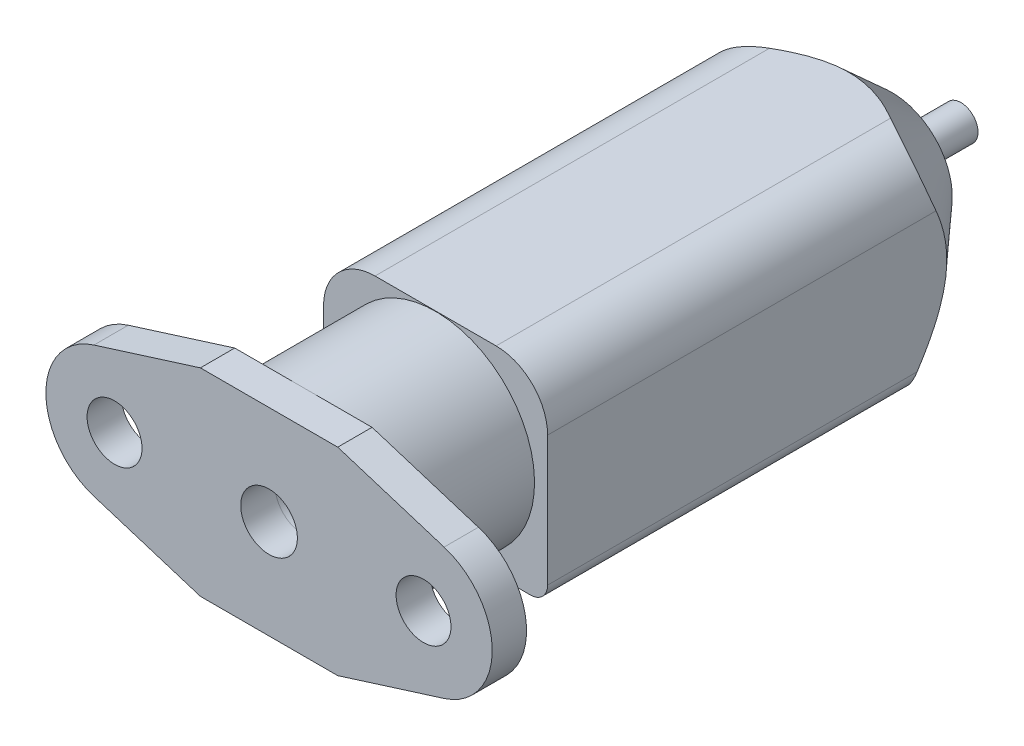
ISO-10303-21;
HEADER;
FILE_DESCRIPTION(('STEP AP214'),'2;1');
FILE_NAME('part.step','',(''),(''),'','','');
FILE_SCHEMA(('AUTOMOTIVE_DESIGN { 1 0 10303 214 1 1 1 1 }'));
ENDSEC;
DATA;
#1=APPLICATION_CONTEXT('core data for automotive mechanical design processes');
#2=APPLICATION_PROTOCOL_DEFINITION('international standard','automotive_design',2000,#1);
#3=PRODUCT_CONTEXT('',#1,'mechanical');
#4=PRODUCT('Part','Part','',(#3));
#5=PRODUCT_RELATED_PRODUCT_CATEGORY('part','',(#4));
#6=PRODUCT_DEFINITION_FORMATION('','',#4);
#7=PRODUCT_DEFINITION_CONTEXT('part definition',#1,'design');
#8=PRODUCT_DEFINITION('design','',#6,#7);
#9=PRODUCT_DEFINITION_SHAPE('','',#8);
#10=(LENGTH_UNIT() NAMED_UNIT(*) SI_UNIT(.MILLI.,.METRE.));
#11=(NAMED_UNIT(*) PLANE_ANGLE_UNIT() SI_UNIT($,.RADIAN.));
#12=(NAMED_UNIT(*) SI_UNIT($,.STERADIAN.) SOLID_ANGLE_UNIT());
#13=UNCERTAINTY_MEASURE_WITH_UNIT(LENGTH_MEASURE(1.E-05),#10,'distance_accuracy_value','');
#14=(GEOMETRIC_REPRESENTATION_CONTEXT(3) GLOBAL_UNCERTAINTY_ASSIGNED_CONTEXT((#13)) GLOBAL_UNIT_ASSIGNED_CONTEXT((#10,
#11,#12)) REPRESENTATION_CONTEXT('',''));
#15=CARTESIAN_POINT('',(0.,0.,0.));
#16=DIRECTION('',(0.,0.,1.));
#17=DIRECTION('',(1.,0.,0.));
#18=AXIS2_PLACEMENT_3D('',#15,#16,#17);
#19=CARTESIAN_POINT('',(-9.00014511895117,-0.00106902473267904,-2.));
#20=DIRECTION('',(0.,0.,1.));
#21=DIRECTION('',(1.,0.,0.));
#22=AXIS2_PLACEMENT_3D('',#19,#20,#21);
#23=PLANE('',#22);
#24=CARTESIAN_POINT('',(0.,0.,-2.));
#25=DIRECTION('',(0.,0.,-1.));
#26=DIRECTION('',(-1.,0.,0.));
#27=AXIS2_PLACEMENT_3D('',#24,#25,#26);
#28=CIRCLE('',#27,5.76499989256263);
#29=CARTESIAN_POINT('',(0.151807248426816,5.76300080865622,-2.));
#30=VERTEX_POINT('',#29);
#31=CARTESIAN_POINT('',(0.,-5.76499989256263,-2.));
#32=VERTEX_POINT('',#31);
#33=EDGE_CURVE('E11',#30,#32,#28,.T.);
#34=ORIENTED_EDGE('',*,*,#33,.F.);
#35=DIRECTION('',(-1.,0.,0.));
#36=VECTOR('',#35,1.);
#37=CARTESIAN_POINT('',(-4.00000018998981,5.76300080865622,-2.));
#38=LINE('',#37,#36);
#39=CARTESIAN_POINT('',(4.00000018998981,5.76300080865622,-2.));
#40=VERTEX_POINT('',#39);
#41=EDGE_CURVE('E282',#40,#30,#38,.T.);
#42=ORIENTED_EDGE('',*,*,#41,.F.);
#43=DIRECTION('',(-0.954143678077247,0.29934902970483,0.));
#44=VECTOR('',#43,1.);
#45=CARTESIAN_POINT('',(4.00000018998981,5.76300080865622,-2.));
#46=LINE('',#45,#44);
#47=CARTESIAN_POINT('',(10.1959695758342,3.81910339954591,-2.));
#48=VERTEX_POINT('',#47);
#49=EDGE_CURVE('E362',#48,#40,#46,.T.);
#50=ORIENTED_EDGE('',*,*,#49,.F.);
#51=CARTESIAN_POINT('',(8.99797345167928,0.000616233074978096,-2.));
#52=DIRECTION('',(0.,0.,1.));
#53=DIRECTION('',(1.,0.,0.));
#54=AXIS2_PLACEMENT_3D('',#51,#52,#53);
#55=CIRCLE('',#54,4.00200436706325);
#56=CARTESIAN_POINT('',(10.1977820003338,-3.81730183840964,-2.));
#57=VERTEX_POINT('',#56);
#58=EDGE_CURVE('E360',#57,#48,#55,.T.);
#59=ORIENTED_EDGE('',*,*,#58,.F.);
#60=DIRECTION('',(0.954001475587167,0.299801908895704,0.));
#61=VECTOR('',#60,1.);
#62=CARTESIAN_POINT('',(4.00000018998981,-5.76499989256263,-2.));
#63=LINE('',#62,#61);
#64=CARTESIAN_POINT('',(4.00000018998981,-5.76499989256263,-2.));
#65=VERTEX_POINT('',#64);
#66=EDGE_CURVE('E357',#65,#57,#63,.T.);
#67=ORIENTED_EDGE('',*,*,#66,.F.);
#68=DIRECTION('',(1.,0.,0.));
#69=VECTOR('',#68,1.);
#70=CARTESIAN_POINT('',(4.00000018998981,-5.76499989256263,-2.));
#71=LINE('',#70,#69);
#72=EDGE_CURVE('E348',#32,#65,#71,.T.);
#73=ORIENTED_EDGE('',*,*,#72,.F.);
#74=EDGE_LOOP('',(#34,#42,#50,#59,#67,#73));
#75=FACE_BOUND('',#74,.T.);
#76=CARTESIAN_POINT('',(8.99797345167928,0.000616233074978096,-2.));
#77=DIRECTION('',(0.,0.,1.));
#78=DIRECTION('',(1.,0.,0.));
#79=AXIS2_PLACEMENT_3D('',#76,#77,#78);
#80=CIRCLE('',#79,1.59816028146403);
#81=CARTESIAN_POINT('',(10.5961337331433,0.000616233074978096,-2.));
#82=VERTEX_POINT('',#81);
#83=EDGE_CURVE('E325',#82,#82,#80,.T.);
#84=ORIENTED_EDGE('',*,*,#83,.T.);
#85=EDGE_LOOP('',(#84));
#86=FACE_BOUND('',#85,.T.);
#87=ADVANCED_FACE('F39',(#75,#86),#23,.F.);
#88=CARTESIAN_POINT('',(0.,0.,-2.));
#89=DIRECTION('',(0.,0.,1.));
#90=DIRECTION('',(1.,0.,0.));
#91=AXIS2_PLACEMENT_3D('',#88,#89,#90);
#92=CIRCLE('',#91,1.65091884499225);
#93=CARTESIAN_POINT('',(1.65091884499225,0.,-2.));
#94=VERTEX_POINT('',#93);
#95=EDGE_CURVE('E224',#94,#94,#92,.T.);
#96=ORIENTED_EDGE('',*,*,#95,.T.);
#97=EDGE_LOOP('',(#96));
#98=FACE_BOUND('',#97,.T.);
#99=CARTESIAN_POINT('',(0.,0.,-2.));
#100=DIRECTION('',(0.,0.,-1.));
#101=DIRECTION('',(-1.,0.,0.));
#102=AXIS2_PLACEMENT_3D('',#99,#100,#101);
#103=CIRCLE('',#102,1.65118654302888);
#104=CARTESIAN_POINT('',(1.65118654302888,0.,-2.));
#105=VERTEX_POINT('',#104);
#106=EDGE_CURVE('E209',#105,#105,#103,.T.);
#107=ORIENTED_EDGE('',*,*,#106,.T.);
#108=EDGE_LOOP('',(#107));
#109=FACE_BOUND('',#108,.T.);
#110=ADVANCED_FACE('F256',(#98,#109),#23,.F.);
#111=CARTESIAN_POINT('',(-9.00014511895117,-0.00106902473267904,-2.));
#112=DIRECTION('',(0.,0.,1.));
#113=DIRECTION('',(1.,0.,0.));
#114=AXIS2_PLACEMENT_3D('',#111,#112,#113);
#115=CYLINDRICAL_SURFACE('',#114,4.00047760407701);
#116=CARTESIAN_POINT('',(-9.00014511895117,-0.00106902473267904,0.));
#117=DIRECTION('',(0.,0.,1.));
#118=DIRECTION('',(1.,0.,0.));
#119=AXIS2_PLACEMENT_3D('',#116,#117,#118);
#120=CIRCLE('',#119,4.00047760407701);
#121=CARTESIAN_POINT('',(-10.1991438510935,3.8155031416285,0.));
#122=VERTEX_POINT('',#121);
#123=CARTESIAN_POINT('',(-10.1990659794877,-3.81766565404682,0.));
#124=VERTEX_POINT('',#123);
#125=EDGE_CURVE('E321',#122,#124,#120,.T.);
#126=ORIENTED_EDGE('',*,*,#125,.F.);
#127=DIRECTION('',(0.,0.,1.));
#128=VECTOR('',#127,1.);
#129=CARTESIAN_POINT('',(-10.1991438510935,3.8155031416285,-2.));
#130=LINE('',#129,#128);
#131=CARTESIAN_POINT('',(-10.1991438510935,3.8155031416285,-2.));
#132=VERTEX_POINT('',#131);
#133=EDGE_CURVE('E288',#132,#122,#130,.T.);
#134=ORIENTED_EDGE('',*,*,#133,.F.);
#135=CARTESIAN_POINT('',(-9.00014511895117,-0.00106902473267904,-2.));
#136=DIRECTION('',(0.,0.,1.));
#137=DIRECTION('',(1.,0.,0.));
#138=AXIS2_PLACEMENT_3D('',#135,#136,#137);
#139=CIRCLE('',#138,4.00047760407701);
#140=CARTESIAN_POINT('',(-10.1990659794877,-3.81766565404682,-2.));
#141=VERTEX_POINT('',#140);
#142=EDGE_CURVE('E344',#132,#141,#139,.T.);
#143=ORIENTED_EDGE('',*,*,#142,.T.);
#144=DIRECTION('',(0.,0.,1.));
#145=VECTOR('',#144,1.);
#146=CARTESIAN_POINT('',(-10.1990659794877,-3.81766565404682,-2.));
#147=LINE('',#146,#145);
#148=EDGE_CURVE('E285',#141,#124,#147,.T.);
#149=ORIENTED_EDGE('',*,*,#148,.T.);
#150=EDGE_LOOP('',(#126,#134,#143,#149));
#151=FACE_BOUND('',#150,.T.);
#152=ADVANCED_FACE('F41',(#151),#115,.T.);
#153=CARTESIAN_POINT('',(-4.00000018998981,5.76300080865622,-2.));
#154=DIRECTION('',(-0.299713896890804,0.954029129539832,0.));
#155=DIRECTION('',(-0.954029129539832,-0.299713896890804,0.));
#156=AXIS2_PLACEMENT_3D('',#153,#154,#155);
#157=PLANE('',#156);
#158=DIRECTION('',(-0.954029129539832,-0.299713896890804,0.));
#159=VECTOR('',#158,1.);
#160=CARTESIAN_POINT('',(-4.00000018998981,5.76300080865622,0.));
#161=LINE('',#160,#159);
#162=CARTESIAN_POINT('',(-4.00000018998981,5.76300080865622,0.));
#163=VERTEX_POINT('',#162);
#164=EDGE_CURVE('E297',#163,#122,#161,.T.);
#165=ORIENTED_EDGE('',*,*,#164,.F.);
#166=DIRECTION('',(0.,0.,1.));
#167=VECTOR('',#166,1.);
#168=CARTESIAN_POINT('',(-4.00000018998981,5.76300080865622,-2.));
#169=LINE('',#168,#167);
#170=CARTESIAN_POINT('',(-4.00000018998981,5.76300080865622,-2.));
#171=VERTEX_POINT('',#170);
#172=EDGE_CURVE('E289',#171,#163,#169,.T.);
#173=ORIENTED_EDGE('',*,*,#172,.F.);
#174=DIRECTION('',(-0.954029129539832,-0.299713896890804,0.));
#175=VECTOR('',#174,1.);
#176=CARTESIAN_POINT('',(-4.00000018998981,5.76300080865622,-2.));
#177=LINE('',#176,#175);
#178=EDGE_CURVE('E311',#171,#132,#177,.T.);
#179=ORIENTED_EDGE('',*,*,#178,.T.);
#180=ORIENTED_EDGE('',*,*,#133,.T.);
#181=EDGE_LOOP('',(#165,#173,#179,#180));
#182=FACE_BOUND('',#181,.T.);
#183=ADVANCED_FACE('F260',(#182),#157,.T.);
#184=CARTESIAN_POINT('',(-4.00000018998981,5.76300080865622,-2.));
#185=DIRECTION('',(0.,1.,0.));
#186=DIRECTION('',(0.,0.,1.));
#187=AXIS2_PLACEMENT_3D('',#184,#185,#186);
#188=PLANE('',#187);
#189=DIRECTION('',(-1.,0.,0.));
#190=VECTOR('',#189,1.);
#191=CARTESIAN_POINT('',(-4.00000018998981,5.76300080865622,0.));
#192=LINE('',#191,#190);
#193=CARTESIAN_POINT('',(4.00000018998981,5.76300080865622,0.));
#194=VERTEX_POINT('',#193);
#195=EDGE_CURVE('E339',#194,#163,#192,.T.);
#196=ORIENTED_EDGE('',*,*,#195,.F.);
#197=DIRECTION('',(0.,0.,1.));
#198=VECTOR('',#197,1.);
#199=CARTESIAN_POINT('',(4.00000018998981,5.76300080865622,-2.));
#200=LINE('',#199,#198);
#201=EDGE_CURVE('E294',#40,#194,#200,.T.);
#202=ORIENTED_EDGE('',*,*,#201,.F.);
#203=ORIENTED_EDGE('',*,*,#41,.T.);
#204=CARTESIAN_POINT('',(0.151807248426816,5.76300080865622,-2.));
#205=DIRECTION('',(-1.,0.,0.));
#206=VECTOR('',#205,1.);
#207=LINE('',#204,#206);
#208=CARTESIAN_POINT('',(-0.151807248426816,5.76300080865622,-2.));
#209=VERTEX_POINT('',#208);
#210=EDGE_CURVE('E219',#30,#209,#207,.T.);
#211=ORIENTED_EDGE('',*,*,#210,.T.);
#212=EDGE_CURVE('E43',#209,#171,#38,.T.);
#213=ORIENTED_EDGE('',*,*,#212,.T.);
#214=ORIENTED_EDGE('',*,*,#172,.T.);
#215=EDGE_LOOP('',(#196,#202,#203,#211,#213,#214));
#216=FACE_BOUND('',#215,.T.);
#217=ADVANCED_FACE('F263',(#216),#188,.T.);
#218=CARTESIAN_POINT('',(4.00000018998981,5.76300080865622,-2.));
#219=DIRECTION('',(0.29934902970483,0.954143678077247,0.));
#220=DIRECTION('',(-0.954143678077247,0.299349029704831,0.));
#221=AXIS2_PLACEMENT_3D('',#218,#219,#220);
#222=PLANE('',#221);
#223=DIRECTION('',(-0.954143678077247,0.29934902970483,0.));
#224=VECTOR('',#223,1.);
#225=CARTESIAN_POINT('',(4.00000018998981,5.76300080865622,0.));
#226=LINE('',#225,#224);
#227=CARTESIAN_POINT('',(10.1959695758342,3.81910339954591,0.));
#228=VERTEX_POINT('',#227);
#229=EDGE_CURVE('E337',#228,#194,#226,.T.);
#230=ORIENTED_EDGE('',*,*,#229,.F.);
#231=DIRECTION('',(0.,0.,1.));
#232=VECTOR('',#231,1.);
#233=CARTESIAN_POINT('',(10.1959695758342,3.81910339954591,-2.));
#234=LINE('',#233,#232);
#235=EDGE_CURVE('E301',#48,#228,#234,.T.);
#236=ORIENTED_EDGE('',*,*,#235,.F.);
#237=ORIENTED_EDGE('',*,*,#49,.T.);
#238=ORIENTED_EDGE('',*,*,#201,.T.);
#239=EDGE_LOOP('',(#230,#236,#237,#238));
#240=FACE_BOUND('',#239,.T.);
#241=ADVANCED_FACE('F268',(#240),#222,.T.);
#242=CARTESIAN_POINT('',(8.99797345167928,0.000616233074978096,-2.));
#243=DIRECTION('',(0.,0.,1.));
#244=DIRECTION('',(1.,0.,0.));
#245=AXIS2_PLACEMENT_3D('',#242,#243,#244);
#246=CYLINDRICAL_SURFACE('',#245,4.00200436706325);
#247=CARTESIAN_POINT('',(8.99797345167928,0.000616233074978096,0.));
#248=DIRECTION('',(0.,0.,1.));
#249=DIRECTION('',(1.,0.,0.));
#250=AXIS2_PLACEMENT_3D('',#247,#248,#249);
#251=CIRCLE('',#250,4.00200436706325);
#252=CARTESIAN_POINT('',(10.1977820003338,-3.81730183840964,0.));
#253=VERTEX_POINT('',#252);
#254=EDGE_CURVE('E334',#253,#228,#251,.T.);
#255=ORIENTED_EDGE('',*,*,#254,.F.);
#256=DIRECTION('',(0.,0.,1.));
#257=VECTOR('',#256,1.);
#258=CARTESIAN_POINT('',(10.1977820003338,-3.81730183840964,-2.));
#259=LINE('',#258,#257);
#260=EDGE_CURVE('E303',#57,#253,#259,.T.);
#261=ORIENTED_EDGE('',*,*,#260,.F.);
#262=ORIENTED_EDGE('',*,*,#58,.T.);
#263=ORIENTED_EDGE('',*,*,#235,.T.);
#264=EDGE_LOOP('',(#255,#261,#262,#263));
#265=FACE_BOUND('',#264,.T.);
#266=ADVANCED_FACE('F639',(#265),#246,.T.);
#267=CARTESIAN_POINT('',(4.00000018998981,-5.76499989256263,-2.));
#268=DIRECTION('',(0.299801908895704,-0.954001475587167,0.));
#269=DIRECTION('',(0.954001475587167,0.299801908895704,0.));
#270=AXIS2_PLACEMENT_3D('',#267,#268,#269);
#271=PLANE('',#270);
#272=DIRECTION('',(0.954001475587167,0.299801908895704,0.));
#273=VECTOR('',#272,1.);
#274=CARTESIAN_POINT('',(4.00000018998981,-5.76499989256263,0.));
#275=LINE('',#274,#273);
#276=CARTESIAN_POINT('',(4.00000018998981,-5.76499989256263,0.));
#277=VERTEX_POINT('',#276);
#278=EDGE_CURVE('E331',#277,#253,#275,.T.);
#279=ORIENTED_EDGE('',*,*,#278,.F.);
#280=DIRECTION('',(0.,0.,1.));
#281=VECTOR('',#280,1.);
#282=CARTESIAN_POINT('',(4.00000018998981,-5.76499989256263,-2.));
#283=LINE('',#282,#281);
#284=EDGE_CURVE('E305',#65,#277,#283,.T.);
#285=ORIENTED_EDGE('',*,*,#284,.F.);
#286=ORIENTED_EDGE('',*,*,#66,.T.);
#287=ORIENTED_EDGE('',*,*,#260,.T.);
#288=EDGE_LOOP('',(#279,#285,#286,#287));
#289=FACE_BOUND('',#288,.T.);
#290=ADVANCED_FACE('F583',(#289),#271,.T.);
#291=CARTESIAN_POINT('',(4.00000018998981,-5.76499989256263,-2.));
#292=DIRECTION('',(0.,-1.,0.));
#293=DIRECTION('',(0.,0.,-1.));
#294=AXIS2_PLACEMENT_3D('',#291,#292,#293);
#295=PLANE('',#294);
#296=DIRECTION('',(1.,0.,0.));
#297=VECTOR('',#296,1.);
#298=CARTESIAN_POINT('',(4.00000018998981,-5.76499989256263,0.));
#299=LINE('',#298,#297);
#300=CARTESIAN_POINT('',(-4.00000018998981,-5.76499989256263,0.));
#301=VERTEX_POINT('',#300);
#302=EDGE_CURVE('E328',#301,#277,#299,.T.);
#303=ORIENTED_EDGE('',*,*,#302,.F.);
#304=DIRECTION('',(0.,0.,1.));
#305=VECTOR('',#304,1.);
#306=CARTESIAN_POINT('',(-4.00000018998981,-5.76499989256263,-2.));
#307=LINE('',#306,#305);
#308=CARTESIAN_POINT('',(-4.00000018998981,-5.76499989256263,-2.));
#309=VERTEX_POINT('',#308);
#310=EDGE_CURVE('E306',#309,#301,#307,.T.);
#311=ORIENTED_EDGE('',*,*,#310,.F.);
#312=EDGE_CURVE('E354',#309,#32,#71,.T.);
#313=ORIENTED_EDGE('',*,*,#312,.T.);
#314=ORIENTED_EDGE('',*,*,#72,.T.);
#315=ORIENTED_EDGE('',*,*,#284,.T.);
#316=EDGE_LOOP('',(#303,#311,#313,#314,#315));
#317=FACE_BOUND('',#316,.T.);
#318=ADVANCED_FACE('F578',(#317),#295,.T.);
#319=CARTESIAN_POINT('',(-4.00000018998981,-5.76499989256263,-2.));
#320=DIRECTION('',(-0.299694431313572,-0.954035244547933,0.));
#321=DIRECTION('',(0.954035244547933,-0.299694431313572,0.));
#322=AXIS2_PLACEMENT_3D('',#319,#320,#321);
#323=PLANE('',#322);
#324=DIRECTION('',(0.954035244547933,-0.299694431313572,0.));
#325=VECTOR('',#324,1.);
#326=CARTESIAN_POINT('',(-4.00000018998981,-5.76499989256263,0.));
#327=LINE('',#326,#325);
#328=EDGE_CURVE('E324',#124,#301,#327,.T.);
#329=ORIENTED_EDGE('',*,*,#328,.F.);
#330=ORIENTED_EDGE('',*,*,#148,.F.);
#331=DIRECTION('',(0.954035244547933,-0.299694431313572,0.));
#332=VECTOR('',#331,1.);
#333=CARTESIAN_POINT('',(-4.00000018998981,-5.76499989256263,-2.));
#334=LINE('',#333,#332);
#335=EDGE_CURVE('E345',#141,#309,#334,.T.);
#336=ORIENTED_EDGE('',*,*,#335,.T.);
#337=ORIENTED_EDGE('',*,*,#310,.T.);
#338=EDGE_LOOP('',(#329,#330,#336,#337));
#339=FACE_BOUND('',#338,.T.);
#340=ADVANCED_FACE('F255',(#339),#323,.T.);
#341=EDGE_CURVE('E49',#32,#209,#28,.T.);
#342=ORIENTED_EDGE('',*,*,#341,.F.);
#343=ORIENTED_EDGE('',*,*,#312,.F.);
#344=ORIENTED_EDGE('',*,*,#335,.F.);
#345=ORIENTED_EDGE('',*,*,#142,.F.);
#346=ORIENTED_EDGE('',*,*,#178,.F.);
#347=ORIENTED_EDGE('',*,*,#212,.F.);
#348=EDGE_LOOP('',(#342,#343,#344,#345,#346,#347));
#349=FACE_BOUND('',#348,.T.);
#350=CARTESIAN_POINT('',(-9.00014511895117,-0.00106902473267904,-2.));
#351=DIRECTION('',(0.,0.,1.));
#352=DIRECTION('',(1.,0.,0.));
#353=AXIS2_PLACEMENT_3D('',#350,#351,#352);
#354=CIRCLE('',#353,1.60099342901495);
#355=CARTESIAN_POINT('',(-7.39915168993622,-0.00106902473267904,-2.));
#356=VERTEX_POINT('',#355);
#357=EDGE_CURVE('E382',#356,#356,#354,.T.);
#358=ORIENTED_EDGE('',*,*,#357,.T.);
#359=EDGE_LOOP('',(#358));
#360=FACE_BOUND('',#359,.T.);
#361=ADVANCED_FACE('F252',(#349,#360),#23,.F.);
#362=CARTESIAN_POINT('',(-9.00014511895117,-0.00106902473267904,0.));
#363=DIRECTION('',(0.,0.,1.));
#364=DIRECTION('',(1.,0.,0.));
#365=AXIS2_PLACEMENT_3D('',#362,#363,#364);
#366=PLANE('',#365);
#367=CARTESIAN_POINT('',(0.,0.,0.));
#368=DIRECTION('',(0.,0.,1.));
#369=DIRECTION('',(1.,0.,0.));
#370=AXIS2_PLACEMENT_3D('',#367,#368,#369);
#371=CIRCLE('',#370,1.65091884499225);
#372=CARTESIAN_POINT('',(1.65091884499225,0.,0.));
#373=VERTEX_POINT('',#372);
#374=EDGE_CURVE('E215',#373,#373,#371,.T.);
#375=ORIENTED_EDGE('',*,*,#374,.F.);
#376=EDGE_LOOP('',(#375));
#377=FACE_BOUND('',#376,.T.);
#378=CARTESIAN_POINT('',(-9.00014511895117,-0.00106902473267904,0.));
#379=DIRECTION('',(0.,0.,1.));
#380=DIRECTION('',(1.,0.,0.));
#381=AXIS2_PLACEMENT_3D('',#378,#379,#380);
#382=CIRCLE('',#381,1.60099342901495);
#383=CARTESIAN_POINT('',(-7.39915168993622,-0.00106902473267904,0.));
#384=VERTEX_POINT('',#383);
#385=EDGE_CURVE('E384',#384,#384,#382,.T.);
#386=ORIENTED_EDGE('',*,*,#385,.F.);
#387=EDGE_LOOP('',(#386));
#388=FACE_BOUND('',#387,.T.);
#389=CARTESIAN_POINT('',(8.99797345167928,0.000616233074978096,0.));
#390=DIRECTION('',(0.,0.,1.));
#391=DIRECTION('',(1.,0.,0.));
#392=AXIS2_PLACEMENT_3D('',#389,#390,#391);
#393=CIRCLE('',#392,1.59816028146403);
#394=CARTESIAN_POINT('',(10.5961337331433,0.000616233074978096,0.));
#395=VERTEX_POINT('',#394);
#396=EDGE_CURVE('E351',#395,#395,#393,.T.);
#397=ORIENTED_EDGE('',*,*,#396,.F.);
#398=EDGE_LOOP('',(#397));
#399=FACE_BOUND('',#398,.T.);
#400=ORIENTED_EDGE('',*,*,#125,.T.);
#401=ORIENTED_EDGE('',*,*,#328,.T.);
#402=ORIENTED_EDGE('',*,*,#302,.T.);
#403=ORIENTED_EDGE('',*,*,#278,.T.);
#404=ORIENTED_EDGE('',*,*,#254,.T.);
#405=ORIENTED_EDGE('',*,*,#229,.T.);
#406=ORIENTED_EDGE('',*,*,#195,.T.);
#407=ORIENTED_EDGE('',*,*,#164,.T.);
#408=EDGE_LOOP('',(#400,#401,#402,#403,#404,#405,#406,#407));
#409=FACE_BOUND('',#408,.T.);
#410=ADVANCED_FACE('F250',(#377,#388,#399,#409),#366,.T.);
#411=CARTESIAN_POINT('',(8.99797345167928,0.000616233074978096,-2.));
#412=DIRECTION('',(0.,0.,1.));
#413=DIRECTION('',(1.,0.,0.));
#414=AXIS2_PLACEMENT_3D('',#411,#412,#413);
#415=CYLINDRICAL_SURFACE('',#414,1.59816028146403);
#416=ORIENTED_EDGE('',*,*,#83,.F.);
#417=EDGE_LOOP('',(#416));
#418=FACE_BOUND('',#417,.T.);
#419=ORIENTED_EDGE('',*,*,#396,.T.);
#420=EDGE_LOOP('',(#419));
#421=FACE_BOUND('',#420,.T.);
#422=ADVANCED_FACE('F246',(#418,#421),#415,.F.);
#423=CARTESIAN_POINT('',(-9.00014511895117,-0.00106902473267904,-2.));
#424=DIRECTION('',(0.,0.,1.));
#425=DIRECTION('',(1.,0.,0.));
#426=AXIS2_PLACEMENT_3D('',#423,#424,#425);
#427=CYLINDRICAL_SURFACE('',#426,1.60099342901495);
#428=ORIENTED_EDGE('',*,*,#357,.F.);
#429=EDGE_LOOP('',(#428));
#430=FACE_BOUND('',#429,.T.);
#431=ORIENTED_EDGE('',*,*,#385,.T.);
#432=EDGE_LOOP('',(#431));
#433=FACE_BOUND('',#432,.T.);
#434=ADVANCED_FACE('F242',(#430,#433),#427,.F.);
#435=CARTESIAN_POINT('',(0.,0.,-2.));
#436=DIRECTION('',(0.,0.,1.));
#437=DIRECTION('',(1.,0.,0.));
#438=AXIS2_PLACEMENT_3D('',#435,#436,#437);
#439=CYLINDRICAL_SURFACE('',#438,1.65091884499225);
#440=ORIENTED_EDGE('',*,*,#95,.F.);
#441=EDGE_LOOP('',(#440));
#442=FACE_BOUND('',#441,.T.);
#443=ORIENTED_EDGE('',*,*,#374,.T.);
#444=EDGE_LOOP('',(#443));
#445=FACE_BOUND('',#444,.T.);
#446=ADVANCED_FACE('F237',(#442,#445),#439,.F.);
#447=CARTESIAN_POINT('',(0.,0.,-9.7));
#448=DIRECTION('',(0.,0.,1.));
#449=DIRECTION('',(1.,0.,0.));
#450=AXIS2_PLACEMENT_3D('',#447,#448,#449);
#451=CYLINDRICAL_SURFACE('',#450,5.76499989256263);
#452=CARTESIAN_POINT('',(0.,0.,-9.7));
#453=DIRECTION('',(0.,0.,-1.));
#454=DIRECTION('',(-1.,0.,0.));
#455=AXIS2_PLACEMENT_3D('',#452,#453,#454);
#456=CIRCLE('',#455,5.76499989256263);
#457=CARTESIAN_POINT('',(-5.76499989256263,0.,-9.7));
#458=VERTEX_POINT('',#457);
#459=EDGE_CURVE('E212',#458,#458,#456,.T.);
#460=ORIENTED_EDGE('',*,*,#459,.F.);
#461=EDGE_LOOP('',(#460));
#462=FACE_BOUND('',#461,.T.);
#463=ORIENTED_EDGE('',*,*,#210,.F.);
#464=ORIENTED_EDGE('',*,*,#33,.T.);
#465=ORIENTED_EDGE('',*,*,#341,.T.);
#466=EDGE_LOOP('',(#463,#464,#465));
#467=FACE_BOUND('',#466,.T.);
#468=ADVANCED_FACE('F226',(#462,#467),#451,.T.);
#469=CARTESIAN_POINT('',(0.,0.,-9.7));
#470=DIRECTION('',(0.,0.,1.));
#471=DIRECTION('',(1.,0.,0.));
#472=AXIS2_PLACEMENT_3D('',#469,#470,#471);
#473=CYLINDRICAL_SURFACE('',#472,1.65118654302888);
#474=CARTESIAN_POINT('',(0.,0.,-9.7));
#475=DIRECTION('',(0.,0.,-1.));
#476=DIRECTION('',(-1.,0.,0.));
#477=AXIS2_PLACEMENT_3D('',#474,#475,#476);
#478=CIRCLE('',#477,1.65118654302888);
#479=CARTESIAN_POINT('',(1.65118654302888,0.,-9.7));
#480=VERTEX_POINT('',#479);
#481=EDGE_CURVE('E206',#480,#480,#478,.T.);
#482=CARTESIAN_POINT('',(1.65118654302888,0.,-9.7));
#483=CARTESIAN_POINT('',(1.65118654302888,0.,-9.61979166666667));
#484=CARTESIAN_POINT('',(1.65118654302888,0.,-9.53958333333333));
#485=CARTESIAN_POINT('',(1.65118654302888,0.,-9.37916666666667));
#486=CARTESIAN_POINT('',(1.65118654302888,0.,-9.29895833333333));
#487=CARTESIAN_POINT('',(1.65118654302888,0.,-9.13854166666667));
#488=CARTESIAN_POINT('',(1.65118654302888,0.,-9.05833333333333));
#489=CARTESIAN_POINT('',(1.65118654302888,0.,-8.89791666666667));
#490=CARTESIAN_POINT('',(1.65118654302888,0.,-8.81770833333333));
#491=CARTESIAN_POINT('',(1.65118654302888,0.,-8.65729166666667));
#492=CARTESIAN_POINT('',(1.65118654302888,0.,-8.57708333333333));
#493=CARTESIAN_POINT('',(1.65118654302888,0.,-8.41666666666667));
#494=CARTESIAN_POINT('',(1.65118654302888,0.,-8.33645833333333));
#495=CARTESIAN_POINT('',(1.65118654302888,0.,-8.17604166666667));
#496=CARTESIAN_POINT('',(1.65118654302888,0.,-8.09583333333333));
#497=CARTESIAN_POINT('',(1.65118654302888,0.,-7.93541666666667));
#498=CARTESIAN_POINT('',(1.65118654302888,0.,-7.85520833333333));
#499=CARTESIAN_POINT('',(1.65118654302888,0.,-7.69479166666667));
#500=CARTESIAN_POINT('',(1.65118654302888,0.,-7.61458333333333));
#501=CARTESIAN_POINT('',(1.65118654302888,0.,-7.45416666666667));
#502=CARTESIAN_POINT('',(1.65118654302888,0.,-7.37395833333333));
#503=CARTESIAN_POINT('',(1.65118654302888,0.,-7.21354166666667));
#504=CARTESIAN_POINT('',(1.65118654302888,0.,-7.13333333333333));
#505=CARTESIAN_POINT('',(1.65118654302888,0.,-6.97291666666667));
#506=CARTESIAN_POINT('',(1.65118654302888,0.,-6.89270833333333));
#507=CARTESIAN_POINT('',(1.65118654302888,0.,-6.73229166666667));
#508=CARTESIAN_POINT('',(1.65118654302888,0.,-6.65208333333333));
#509=CARTESIAN_POINT('',(1.65118654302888,0.,-6.49166666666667));
#510=CARTESIAN_POINT('',(1.65118654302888,0.,-6.41145833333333));
#511=CARTESIAN_POINT('',(1.65118654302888,0.,-6.25104166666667));
#512=CARTESIAN_POINT('',(1.65118654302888,0.,-6.17083333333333));
#513=CARTESIAN_POINT('',(1.65118654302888,0.,-6.01041666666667));
#514=CARTESIAN_POINT('',(1.65118654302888,0.,-5.93020833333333));
#515=CARTESIAN_POINT('',(1.65118654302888,0.,-5.76979166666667));
#516=CARTESIAN_POINT('',(1.65118654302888,0.,-5.68958333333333));
#517=CARTESIAN_POINT('',(1.65118654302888,0.,-5.52916666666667));
#518=CARTESIAN_POINT('',(1.65118654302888,0.,-5.44895833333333));
#519=CARTESIAN_POINT('',(1.65118654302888,0.,-5.28854166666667));
#520=CARTESIAN_POINT('',(1.65118654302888,0.,-5.20833333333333));
#521=CARTESIAN_POINT('',(1.65118654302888,0.,-5.04791666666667));
#522=CARTESIAN_POINT('',(1.65118654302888,0.,-4.96770833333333));
#523=CARTESIAN_POINT('',(1.65118654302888,0.,-4.80729166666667));
#524=CARTESIAN_POINT('',(1.65118654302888,0.,-4.72708333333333));
#525=CARTESIAN_POINT('',(1.65118654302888,0.,-4.56666666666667));
#526=CARTESIAN_POINT('',(1.65118654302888,0.,-4.48645833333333));
#527=CARTESIAN_POINT('',(1.65118654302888,0.,-4.32604166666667));
#528=CARTESIAN_POINT('',(1.65118654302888,0.,-4.24583333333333));
#529=CARTESIAN_POINT('',(1.65118654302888,0.,-4.08541666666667));
#530=CARTESIAN_POINT('',(1.65118654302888,0.,-4.00520833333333));
#531=CARTESIAN_POINT('',(1.65118654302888,0.,-3.84479166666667));
#532=CARTESIAN_POINT('',(1.65118654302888,0.,-3.76458333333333));
#533=CARTESIAN_POINT('',(1.65118654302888,0.,-3.60416666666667));
#534=CARTESIAN_POINT('',(1.65118654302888,0.,-3.52395833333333));
#535=CARTESIAN_POINT('',(1.65118654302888,0.,-3.36354166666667));
#536=CARTESIAN_POINT('',(1.65118654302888,0.,-3.28333333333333));
#537=CARTESIAN_POINT('',(1.65118654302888,0.,-3.12291666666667));
#538=CARTESIAN_POINT('',(1.65118654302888,0.,-3.04270833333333));
#539=CARTESIAN_POINT('',(1.65118654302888,0.,-2.88229166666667));
#540=CARTESIAN_POINT('',(1.65118654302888,0.,-2.80208333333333));
#541=CARTESIAN_POINT('',(1.65118654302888,0.,-2.64166666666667));
#542=CARTESIAN_POINT('',(1.65118654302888,0.,-2.56145833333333));
#543=CARTESIAN_POINT('',(1.65118654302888,0.,-2.40104166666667));
#544=CARTESIAN_POINT('',(1.65118654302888,0.,-2.32083333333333));
#545=CARTESIAN_POINT('',(1.65118654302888,0.,-2.16041666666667));
#546=CARTESIAN_POINT('',(1.65118654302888,0.,-2.08020833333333));
#547=CARTESIAN_POINT('',(1.65118654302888,0.,-2.));
#548=B_SPLINE_CURVE_WITH_KNOTS('',3,(#482,#483,#484,#485,#486,#487,#488,#489,#490,#491,#492,
#493,#494,#495,#496,#497,#498,#499,#500,#501,#502,#503,#504,#505,#506,#507,#508,#509,#510,#511,
#512,#513,#514,#515,#516,#517,#518,#519,#520,#521,#522,#523,#524,#525,#526,#527,#528,#529,#530,
#531,#532,#533,#534,#535,#536,#537,#538,#539,#540,#541,#542,#543,#544,#545,#546,#547),
.UNSPECIFIED.,.F.,.F.,(4,2,2,2,2,2,2,2,2,2,2,2,2,2,2,2,2,2,2,2,2,2,2,2,2,2,2,2,2,2,2,2,4),(0.,
0.240625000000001,0.481250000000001,0.721875,0.962500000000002,1.203125,1.44375,1.684375,1.925,
2.165625,2.40625,2.646875,2.8875,3.128125,3.36875,3.609375,3.85,4.090625,4.33125,4.571875,
4.8125,5.053125,5.29375,5.534375,5.775,6.015625,6.25625,6.496875,6.7375,6.978125,7.21875,
7.459375,7.7),.UNSPECIFIED.);
#549=EDGE_CURVE('BSEAM236',#480,#105,#548,.T.);
#550=ORIENTED_EDGE('',*,*,#481,.T.);
#551=ORIENTED_EDGE('',*,*,#106,.F.);
#552=ORIENTED_EDGE('',*,*,#549,.T.);
#553=ORIENTED_EDGE('',*,*,#549,.F.);
#554=EDGE_LOOP('',(#550,#552,#551,#553));
#555=FACE_BOUND('',#554,.T.);
#556=ADVANCED_FACE('F236',(#555),#473,.F.);
#557=CARTESIAN_POINT('',(3.52686845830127,2.78377470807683,-9.7));
#558=DIRECTION('',(0.,0.,-1.));
#559=DIRECTION('',(-1.,0.,0.));
#560=AXIS2_PLACEMENT_3D('',#557,#558,#559);
#561=PLANE('',#560);
#562=ORIENTED_EDGE('',*,*,#481,.F.);
#563=EDGE_LOOP('',(#562));
#564=FACE_BOUND('',#563,.T.);
#565=ADVANCED_FACE('F397',(#564),#561,.F.);
#566=CARTESIAN_POINT('',(3.52686845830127,2.78377470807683,-36.3));
#567=DIRECTION('',(0.,0.,1.));
#568=DIRECTION('',(1.,0.,0.));
#569=AXIS2_PLACEMENT_3D('',#566,#567,#568);
#570=CYLINDRICAL_SURFACE('',#569,3.);
#571=DIRECTION('',(0.,0.,1.));
#572=VECTOR('',#571,1.);
#573=CARTESIAN_POINT('',(6.52686845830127,2.78377470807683,-36.3));
#574=LINE('',#573,#572);
#575=CARTESIAN_POINT('',(6.52686845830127,2.78377470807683,-32.3254144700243));
#576=VERTEX_POINT('',#575);
#577=CARTESIAN_POINT('',(6.52686845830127,2.78377470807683,-9.7));
#578=VERTEX_POINT('',#577);
#579=EDGE_CURVE('E178',#576,#578,#574,.T.);
#580=ORIENTED_EDGE('',*,*,#579,.F.);
#581=CARTESIAN_POINT('',(6.52686845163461,2.78357470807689,-32.3255012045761));
#582=CARTESIAN_POINT('',(6.52687944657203,2.85455658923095,-32.2947133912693));
#583=CARTESIAN_POINT('',(6.52435831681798,2.92612701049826,-32.2652428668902));
#584=CARTESIAN_POINT('',(6.51404962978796,3.07003954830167,-32.2091297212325));
#585=CARTESIAN_POINT('',(6.50625895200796,3.14238209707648,-32.1824887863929));
#586=CARTESIAN_POINT('',(6.485172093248,3.28759904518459,-32.1321782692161));
#587=CARTESIAN_POINT('',(6.47185696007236,3.36047441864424,-32.1085192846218));
#588=CARTESIAN_POINT('',(6.4396055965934,3.50594001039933,-32.0644981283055));
#589=CARTESIAN_POINT('',(6.42067042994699,3.57853028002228,-32.044135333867));
#590=CARTESIAN_POINT('',(6.35511772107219,3.79562342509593,-31.9881471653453));
#591=CARTESIAN_POINT('',(6.29981284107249,3.93902021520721,-31.9577707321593));
#592=CARTESIAN_POINT('',(6.16674471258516,4.21723018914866,-31.9124856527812));
#593=CARTESIAN_POINT('',(6.0890270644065,4.35206012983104,-31.8975458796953));
#594=CARTESIAN_POINT('',(5.9191047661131,4.59987714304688,-31.8841781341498));
#595=CARTESIAN_POINT('',(5.82823664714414,4.71372494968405,-31.8847010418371));
#596=CARTESIAN_POINT('',(5.63145782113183,4.92660460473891,-31.8996707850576));
#597=CARTESIAN_POINT('',(5.52554108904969,5.02563048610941,-31.9141232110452));
#598=CARTESIAN_POINT('',(5.3052007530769,5.20391928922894,-31.9557931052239));
#599=CARTESIAN_POINT('',(5.1910759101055,5.28363530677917,-31.982663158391));
#600=CARTESIAN_POINT('',(4.95547754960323,5.42536194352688,-32.0480587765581));
#601=CARTESIAN_POINT('',(4.83400385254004,5.48737212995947,-32.086584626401));
#602=CARTESIAN_POINT('',(4.57927146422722,5.59675704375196,-32.176857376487));
#603=CARTESIAN_POINT('',(4.44575378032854,5.64295521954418,-32.2292874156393));
#604=CARTESIAN_POINT('',(4.17779883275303,5.7155939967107,-32.344439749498));
#605=CARTESIAN_POINT('',(4.0433613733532,5.74203025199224,-32.4071643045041));
#606=CARTESIAN_POINT('',(3.84538611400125,5.76753239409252,-32.5067639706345));
#607=CARTESIAN_POINT('',(3.78098106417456,5.7736824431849,-32.5403212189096));
#608=CARTESIAN_POINT('',(3.65311128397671,5.78179898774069,-32.609246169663));
#609=CARTESIAN_POINT('',(3.58964442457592,5.78377715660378,-32.6446085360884));
#610=CARTESIAN_POINT('',(3.52666845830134,5.78377470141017,-32.6808519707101));
#611=B_SPLINE_CURVE_WITH_KNOTS('',3,(#581,#582,#583,#584,#585,#586,#587,#588,#589,#590,#591,
#592,#593,#594,#595,#596,#597,#598,#599,#600,#601,#602,#603,#604,#605,#606,#607,#608,#609,#610),
.UNSPECIFIED.,.F.,.F.,(4,2,2,2,2,2,2,2,2,2,2,2,2,2,4),(0.,0.232080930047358,0.464299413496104,
0.697321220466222,0.93029895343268,1.39760891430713,1.86397472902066,2.29877580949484,
2.7337514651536,3.15723266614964,3.58072421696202,4.03105402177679,4.48148283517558,
4.70000815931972,4.91792120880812),.UNSPECIFIED.);
#612=CARTESIAN_POINT('',(3.52686845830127,5.78377470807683,-32.6807368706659));
#613=VERTEX_POINT('',#612);
#614=EDGE_CURVE('E165',#576,#613,#611,.T.);
#615=ORIENTED_EDGE('',*,*,#614,.T.);
#616=DIRECTION('',(0.,0.,1.));
#617=VECTOR('',#616,1.);
#618=CARTESIAN_POINT('',(3.52686845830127,5.78377470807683,-36.3));
#619=LINE('',#618,#617);
#620=CARTESIAN_POINT('',(3.52686845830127,5.78377470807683,-9.7));
#621=VERTEX_POINT('',#620);
#622=EDGE_CURVE('E176',#613,#621,#619,.T.);
#623=ORIENTED_EDGE('',*,*,#622,.T.);
#624=CARTESIAN_POINT('',(3.52686845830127,2.78377470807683,-9.7));
#625=DIRECTION('',(0.,0.,-1.));
#626=DIRECTION('',(-1.,0.,0.));
#627=AXIS2_PLACEMENT_3D('',#624,#625,#626);
#628=CIRCLE('',#627,3.);
#629=EDGE_CURVE('E179',#621,#578,#628,.T.);
#630=ORIENTED_EDGE('',*,*,#629,.T.);
#631=EDGE_LOOP('',(#580,#615,#623,#630));
#632=FACE_BOUND('',#631,.T.);
#633=ADVANCED_FACE('F174',(#632),#570,.T.);
#634=CARTESIAN_POINT('',(6.52686845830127,2.78377470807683,-36.3));
#635=DIRECTION('',(-1.,0.,0.));
#636=DIRECTION('',(0.,-1.,0.));
#637=AXIS2_PLACEMENT_3D('',#634,#635,#636);
#638=PLANE('',#637);
#639=DIRECTION('',(0.,0.,1.));
#640=VECTOR('',#639,1.);
#641=CARTESIAN_POINT('',(6.52686845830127,-4.78377470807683,-36.3));
#642=LINE('',#641,#640);
#643=CARTESIAN_POINT('',(6.52686845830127,-4.78377470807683,-31.2239012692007));
#644=VERTEX_POINT('',#643);
#645=CARTESIAN_POINT('',(6.52686845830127,-4.78377470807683,-9.7));
#646=VERTEX_POINT('',#645);
#647=EDGE_CURVE('E203',#644,#646,#642,.T.);
#648=ORIENTED_EDGE('',*,*,#647,.F.);
#649=CARTESIAN_POINT('',(6.52686845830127,-9.83774144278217,-27.1188852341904));
#650=CARTESIAN_POINT('',(6.52686845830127,-9.61075568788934,-27.3279160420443));
#651=CARTESIAN_POINT('',(6.52686845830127,-9.38270054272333,-27.5358002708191));
#652=CARTESIAN_POINT('',(6.52686845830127,-8.92393950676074,-27.948704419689));
#653=CARTESIAN_POINT('',(6.52686845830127,-8.69323314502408,-28.1537238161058));
#654=CARTESIAN_POINT('',(6.52686845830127,-8.22700449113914,-28.5617695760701));
#655=CARTESIAN_POINT('',(6.52686845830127,-7.99145909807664,-28.7647696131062));
#656=CARTESIAN_POINT('',(6.52686845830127,-7.51662481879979,-29.1663184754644));
#657=CARTESIAN_POINT('',(6.52686845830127,-7.27733620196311,-29.3648676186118));
#658=CARTESIAN_POINT('',(6.52686845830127,-6.7703806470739,-29.7756929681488));
#659=CARTESIAN_POINT('',(6.52686845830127,-6.50224305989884,-29.9873908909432));
#660=CARTESIAN_POINT('',(6.52686845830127,-5.9590869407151,-30.4019636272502));
#661=CARTESIAN_POINT('',(6.52686845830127,-5.68406680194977,-30.6048363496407));
#662=CARTESIAN_POINT('',(6.52686845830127,-5.12639878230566,-30.9979951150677));
#663=CARTESIAN_POINT('',(6.52686845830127,-4.84377718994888,-31.1883182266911));
#664=CARTESIAN_POINT('',(6.52686845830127,-4.2681620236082,-31.5525095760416));
#665=CARTESIAN_POINT('',(6.52686845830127,-3.97517478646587,-31.7263876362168));
#666=CARTESIAN_POINT('',(6.52686845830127,-3.55871516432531,-31.9522679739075));
#667=CARTESIAN_POINT('',(6.52686845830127,-3.44054221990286,-32.0140666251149));
#668=CARTESIAN_POINT('',(6.52686845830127,-3.20214974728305,-32.1335776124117));
#669=CARTESIAN_POINT('',(6.52686845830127,-3.08193022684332,-32.1912899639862));
#670=CARTESIAN_POINT('',(6.52686845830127,-2.7179922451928,-32.3574764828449));
#671=CARTESIAN_POINT('',(6.52686845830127,-2.47101706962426,-32.4589875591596));
#672=CARTESIAN_POINT('',(6.52686845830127,-1.9733063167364,-32.6360884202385));
#673=CARTESIAN_POINT('',(6.52686845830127,-1.72274612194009,-32.7121582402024));
#674=CARTESIAN_POINT('',(6.52686845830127,-1.34177055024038,-32.8046181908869));
#675=CARTESIAN_POINT('',(6.52686845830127,-1.21394636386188,-32.8318277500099));
#676=CARTESIAN_POINT('',(6.52686845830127,-0.956891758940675,-32.8784386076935));
#677=CARTESIAN_POINT('',(6.52686845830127,-0.827661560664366,-32.8978411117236));
#678=CARTESIAN_POINT('',(6.52686845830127,-0.518905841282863,-32.9341204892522));
#679=CARTESIAN_POINT('',(6.52686845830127,-0.338921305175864,-32.9472386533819));
#680=CARTESIAN_POINT('',(6.52686845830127,0.021455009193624,-32.9569242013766));
#681=CARTESIAN_POINT('',(6.52686845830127,0.201846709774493,-32.9534945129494));
#682=CARTESIAN_POINT('',(6.52686845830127,0.562042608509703,-32.9302500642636));
#683=CARTESIAN_POINT('',(6.52686845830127,0.741843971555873,-32.9103917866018));
#684=CARTESIAN_POINT('',(6.52686845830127,1.09906303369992,-32.8552599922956));
#685=CARTESIAN_POINT('',(6.52686845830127,1.2764801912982,-32.8199830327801));
#686=CARTESIAN_POINT('',(6.52686845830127,1.69339387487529,-32.7198896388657));
#687=CARTESIAN_POINT('',(6.52686845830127,1.93142332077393,-32.6489658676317));
#688=CARTESIAN_POINT('',(6.52686845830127,2.40004450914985,-32.485855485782));
#689=CARTESIAN_POINT('',(6.52686845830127,2.63063201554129,-32.3936570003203));
#690=CARTESIAN_POINT('',(6.52686845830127,3.08713934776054,-32.1912876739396));
#691=CARTESIAN_POINT('',(6.52686845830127,3.31296534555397,-32.0809074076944));
#692=CARTESIAN_POINT('',(6.52686845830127,3.64633509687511,-31.9054004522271));
#693=CARTESIAN_POINT('',(6.52686845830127,3.7565505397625,-31.8452498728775));
#694=CARTESIAN_POINT('',(6.52686845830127,3.97532488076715,-31.7220102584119));
#695=CARTESIAN_POINT('',(6.52686845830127,4.08388382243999,-31.6589213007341));
#696=CARTESIAN_POINT('',(6.52686845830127,4.40068549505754,-31.4696967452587));
#697=CARTESIAN_POINT('',(6.52686845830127,4.6067999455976,-31.339993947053));
#698=CARTESIAN_POINT('',(6.52686845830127,5.01402818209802,-31.0729311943));
#699=CARTESIAN_POINT('',(6.52686845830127,5.21514087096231,-30.9355695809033));
#700=CARTESIAN_POINT('',(6.52686845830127,5.61321549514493,-30.6546421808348));
#701=CARTESIAN_POINT('',(6.52686845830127,5.81017392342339,-30.5110714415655));
#702=CARTESIAN_POINT('',(6.52686845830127,6.20038419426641,-30.2190246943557));
#703=CARTESIAN_POINT('',(6.52686845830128,6.39363630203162,-30.0705490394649));
#704=CARTESIAN_POINT('',(6.52686845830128,6.7777866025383,-29.7689587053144));
#705=CARTESIAN_POINT('',(6.52686845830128,6.96867157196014,-29.6158272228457));
#706=CARTESIAN_POINT('',(6.52686845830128,7.34771482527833,-29.3062212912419));
#707=CARTESIAN_POINT('',(6.52686845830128,7.53587301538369,-29.1497467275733));
#708=CARTESIAN_POINT('',(6.52686845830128,8.09666998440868,-28.6763187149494));
#709=CARTESIAN_POINT('',(6.52686845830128,8.46580931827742,-28.3552193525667));
#710=CARTESIAN_POINT('',(6.52686845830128,9.16172302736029,-27.736571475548));
#711=CARTESIAN_POINT('',(6.52686845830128,9.48914432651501,-27.4397454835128));
#712=CARTESIAN_POINT('',(6.52686845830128,10.1395021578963,-26.8411493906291));
#713=CARTESIAN_POINT('',(6.52686845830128,10.4624381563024,-26.5393787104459));
#714=CARTESIAN_POINT('',(6.52686845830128,11.1017843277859,-25.9347937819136));
#715=CARTESIAN_POINT('',(6.52686845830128,11.4182271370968,-25.6320139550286));
#716=CARTESIAN_POINT('',(6.52686845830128,12.048142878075,-25.0235029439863));
#717=CARTESIAN_POINT('',(6.52686845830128,12.3616163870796,-24.7177723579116));
#718=CARTESIAN_POINT('',(6.52686845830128,12.6739536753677,-24.4108979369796));
#719=B_SPLINE_CURVE_WITH_KNOTS('',3,(#649,#650,#651,#652,#653,#654,#655,#656,#657,#658,#659,
#660,#661,#662,#663,#664,#665,#666,#667,#668,#669,#670,#671,#672,#673,#674,#675,#676,#677,#678,
#679,#680,#681,#682,#683,#684,#685,#686,#687,#688,#689,#690,#691,#692,#693,#694,#695,#696,#697,
#698,#699,#700,#701,#702,#703,#704,#705,#706,#707,#708,#709,#710,#711,#712,#713,#714,#715,#716,
#717,#718),.UNSPECIFIED.,.F.,.F.,(4,2,2,2,2,2,2,2,2,2,2,2,2,2,2,2,2,2,2,2,2,2,2,2,2,2,2,2,2,2,2,
2,2,2,4),(0.,0.925725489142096,1.85161803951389,2.78442669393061,3.71716852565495,
4.7419331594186,5.76693930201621,6.788767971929,7.80998240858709,8.20998345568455,
8.60998298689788,9.41005970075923,10.1940538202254,10.5859093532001,10.9777043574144,
11.5183190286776,12.0588380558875,12.6007934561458,13.1428699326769,13.8866679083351,
14.6308820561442,15.3843597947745,15.7610080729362,16.1376464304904,16.8679939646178,
17.5985003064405,18.3296004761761,19.0606481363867,19.7947529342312,20.5288829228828,
21.996460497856,23.3222252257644,24.6481464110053,25.9620148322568,27.2756223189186),.UNSPECIFIED.);
#720=EDGE_CURVE('E180',#644,#576,#719,.T.);
#721=ORIENTED_EDGE('',*,*,#720,.T.);
#722=ORIENTED_EDGE('',*,*,#579,.T.);
#723=DIRECTION('',(0.,-1.,0.));
#724=VECTOR('',#723,1.);
#725=CARTESIAN_POINT('',(6.52686845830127,2.78377470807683,-9.7));
#726=LINE('',#725,#724);
#727=EDGE_CURVE('E428',#578,#646,#726,.T.);
#728=ORIENTED_EDGE('',*,*,#727,.T.);
#729=EDGE_LOOP('',(#648,#721,#722,#728));
#730=FACE_BOUND('',#729,.T.);
#731=ADVANCED_FACE('F409',(#730),#638,.F.);
#732=CARTESIAN_POINT('',(5.52686845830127,-4.78377470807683,-36.3));
#733=DIRECTION('',(0.,0.,1.));
#734=DIRECTION('',(1.,0.,0.));
#735=AXIS2_PLACEMENT_3D('',#732,#733,#734);
#736=CYLINDRICAL_SURFACE('',#735,1.);
#737=DIRECTION('',(0.,0.,1.));
#738=VECTOR('',#737,1.);
#739=CARTESIAN_POINT('',(5.52686845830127,-5.78377470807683,-36.3));
#740=LINE('',#739,#738);
#741=CARTESIAN_POINT('',(5.52686845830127,-5.78377470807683,-31.3259867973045));
#742=VERTEX_POINT('',#741);
#743=CARTESIAN_POINT('',(5.52686845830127,-5.78377470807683,-9.7));
#744=VERTEX_POINT('',#743);
#745=EDGE_CURVE('E201',#742,#744,#740,.T.);
#746=ORIENTED_EDGE('',*,*,#745,.F.);
#747=CARTESIAN_POINT('',(5.52666845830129,-5.78377468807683,-31.3261395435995));
#748=CARTESIAN_POINT('',(5.57509042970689,-5.7837882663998,-31.2891429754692));
#749=CARTESIAN_POINT('',(5.62498894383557,-5.78026910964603,-31.2536046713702));
#750=CARTESIAN_POINT('',(5.72691672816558,-5.76492933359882,-31.1867099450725));
#751=CARTESIAN_POINT('',(5.77896142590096,-5.75303231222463,-31.1553951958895));
#752=CARTESIAN_POINT('',(5.87195230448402,-5.72331957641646,-31.1051499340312));
#753=CARTESIAN_POINT('',(5.91282701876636,-5.70737627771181,-31.0850098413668));
#754=CARTESIAN_POINT('',(5.99363278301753,-5.66927891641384,-31.0495220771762));
#755=CARTESIAN_POINT('',(6.03356641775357,-5.64714473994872,-31.0341593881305));
#756=CARTESIAN_POINT('',(6.11160939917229,-5.59634061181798,-31.0090072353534));
#757=CARTESIAN_POINT('',(6.14969753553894,-5.56760991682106,-30.9992727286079));
#758=CARTESIAN_POINT('',(6.22196435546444,-5.50429110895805,-30.9864220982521));
#759=CARTESIAN_POINT('',(6.25614377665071,-5.46970410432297,-30.9833047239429));
#760=CARTESIAN_POINT('',(6.31468780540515,-5.40109785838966,-30.9839210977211));
#761=CARTESIAN_POINT('',(6.33975616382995,-5.36766441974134,-30.9867651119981));
#762=CARTESIAN_POINT('',(6.38521393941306,-5.298511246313,-30.9973599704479));
#763=CARTESIAN_POINT('',(6.4056056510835,-5.26279264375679,-31.0051084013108));
#764=CARTESIAN_POINT('',(6.44128079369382,-5.19054167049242,-31.0249249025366));
#765=CARTESIAN_POINT('',(6.45661412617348,-5.15402128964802,-31.0369481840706));
#766=CARTESIAN_POINT('',(6.48256971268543,-5.08067871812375,-31.0647404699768));
#767=CARTESIAN_POINT('',(6.49318345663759,-5.04385610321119,-31.0805161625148));
#768=CARTESIAN_POINT('',(6.51034616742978,-4.96901511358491,-31.1159641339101));
#769=CARTESIAN_POINT('',(6.51668598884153,-4.93101952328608,-31.1357821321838));
#770=CARTESIAN_POINT('',(6.52494149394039,-4.85628230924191,-31.1780687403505));
#771=CARTESIAN_POINT('',(6.52687976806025,-4.81953524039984,-31.2005231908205));
#772=CARTESIAN_POINT('',(6.52686843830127,-4.78357470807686,-31.2240319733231));
#773=B_SPLINE_CURVE_WITH_KNOTS('',3,(#747,#748,#749,#750,#751,#752,#753,#754,#755,#756,#757,
#758,#759,#760,#761,#762,#763,#764,#765,#766,#767,#768,#769,#770,#771,#772),.UNSPECIFIED.,.F.,
.F.,(4,2,2,2,2,2,2,2,2,2,2,2,4),(0.,0.18313838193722,0.367968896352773,0.512228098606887,
0.656029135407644,0.801211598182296,0.946366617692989,1.07140186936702,1.19637564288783,
1.320076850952,1.44400021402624,1.57361684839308,1.70256672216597),.UNSPECIFIED.);
#774=EDGE_CURVE('E472',#742,#644,#773,.T.);
#775=ORIENTED_EDGE('',*,*,#774,.T.);
#776=ORIENTED_EDGE('',*,*,#647,.T.);
#777=CARTESIAN_POINT('',(5.52686845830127,-4.78377470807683,-9.7));
#778=DIRECTION('',(0.,0.,-1.));
#779=DIRECTION('',(1.,0.,0.));
#780=AXIS2_PLACEMENT_3D('',#777,#778,#779);
#781=CIRCLE('',#780,1.);
#782=EDGE_CURVE('E430',#646,#744,#781,.T.);
#783=ORIENTED_EDGE('',*,*,#782,.T.);
#784=EDGE_LOOP('',(#746,#775,#776,#783));
#785=FACE_BOUND('',#784,.T.);
#786=ADVANCED_FACE('F469',(#785),#736,.T.);
#787=CARTESIAN_POINT('',(-5.52686845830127,-5.78377470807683,-36.3));
#788=DIRECTION('',(0.,1.,0.));
#789=DIRECTION('',(0.,0.,1.));
#790=AXIS2_PLACEMENT_3D('',#787,#788,#789);
#791=PLANE('',#790);
#792=DIRECTION('',(0.,0.,1.));
#793=VECTOR('',#792,1.);
#794=CARTESIAN_POINT('',(-5.52686845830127,-5.78377470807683,-36.3));
#795=LINE('',#794,#793);
#796=CARTESIAN_POINT('',(-5.52686845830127,-5.78377470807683,-31.3259867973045));
#797=VERTEX_POINT('',#796);
#798=CARTESIAN_POINT('',(-5.52686845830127,-5.78377470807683,-9.7));
#799=VERTEX_POINT('',#798);
#800=EDGE_CURVE('E199',#797,#799,#795,.T.);
#801=ORIENTED_EDGE('',*,*,#800,.F.);
#802=CARTESIAN_POINT('',(-10.7651471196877,-5.78377470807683,-26.6606988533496));
#803=CARTESIAN_POINT('',(-10.5164486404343,-5.78377470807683,-26.902821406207));
#804=CARTESIAN_POINT('',(-10.2668454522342,-5.78377470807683,-27.1440241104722));
#805=CARTESIAN_POINT('',(-9.76534612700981,-5.78377470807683,-27.6240977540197));
#806=CARTESIAN_POINT('',(-9.5134496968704,-5.78377470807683,-27.8629683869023));
#807=CARTESIAN_POINT('',(-9.00557174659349,-5.78377470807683,-28.3391098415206));
#808=CARTESIAN_POINT('',(-8.74957548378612,-5.78377470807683,-28.5763649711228));
#809=CARTESIAN_POINT('',(-8.23423079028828,-5.78377470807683,-29.0471803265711));
#810=CARTESIAN_POINT('',(-7.97488256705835,-5.78377470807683,-29.2807407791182));
#811=CARTESIAN_POINT('',(-7.43432008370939,-5.78377470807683,-29.7587993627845));
#812=CARTESIAN_POINT('',(-7.15281359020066,-5.78377470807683,-30.0029683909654));
#813=CARTESIAN_POINT('',(-6.58366773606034,-5.78377470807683,-30.4841870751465));
#814=CARTESIAN_POINT('',(-6.29602720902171,-5.78377470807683,-30.7212353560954));
#815=CARTESIAN_POINT('',(-5.7135325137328,-5.78377470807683,-31.184980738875));
#816=CARTESIAN_POINT('',(-5.41869678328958,-5.78377470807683,-31.4117007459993));
#817=CARTESIAN_POINT('',(-4.9688079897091,-5.78377470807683,-31.7412534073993));
#818=CARTESIAN_POINT('',(-4.81759778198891,-5.78377470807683,-31.8493329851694));
#819=CARTESIAN_POINT('',(-4.51223556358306,-5.78377470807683,-32.0612428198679));
#820=CARTESIAN_POINT('',(-4.35808384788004,-5.78377470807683,-32.1650734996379));
#821=CARTESIAN_POINT('',(-4.10147376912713,-5.78377470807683,-32.3317971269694));
#822=CARTESIAN_POINT('',(-3.99999264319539,-5.78377470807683,-32.3961936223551));
#823=CARTESIAN_POINT('',(-3.79550398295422,-5.78377470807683,-32.5225125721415));
#824=CARTESIAN_POINT('',(-3.69249644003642,-5.78377470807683,-32.5844350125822));
#825=CARTESIAN_POINT('',(-3.38091833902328,-5.78377470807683,-32.7660231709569));
#826=CARTESIAN_POINT('',(-3.16984708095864,-5.78377470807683,-32.8814736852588));
#827=CARTESIAN_POINT('',(-2.74212925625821,-5.78377470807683,-33.0965758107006));
#828=CARTESIAN_POINT('',(-2.52555072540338,-5.78377470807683,-33.1963613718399));
#829=CARTESIAN_POINT('',(-2.08454763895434,-5.78377470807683,-33.3768099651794));
#830=CARTESIAN_POINT('',(-1.86012861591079,-5.78377470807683,-33.457486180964));
#831=CARTESIAN_POINT('',(-1.48087906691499,-5.78377470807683,-33.571331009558));
#832=CARTESIAN_POINT('',(-1.32810368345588,-5.78377470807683,-33.6113457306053));
#833=CARTESIAN_POINT('',(-1.0198415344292,-5.78377470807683,-33.6791213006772));
#834=CARTESIAN_POINT('',(-0.864355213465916,-5.78377470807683,-33.7068841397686));
#835=CARTESIAN_POINT('',(-0.551927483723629,-5.78377470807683,-33.7488399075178));
#836=CARTESIAN_POINT('',(-0.394990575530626,-5.78377470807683,-33.7630659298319));
#837=CARTESIAN_POINT('',(-0.080462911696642,-5.78377470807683,-33.7773425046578));
#838=CARTESIAN_POINT('',(0.0771278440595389,-5.78377470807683,-33.777393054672));
#839=CARTESIAN_POINT('',(0.391639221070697,-5.78377470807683,-33.7633167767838));
#840=CARTESIAN_POINT('',(0.548559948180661,-5.78377470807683,-33.7491922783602));
#841=CARTESIAN_POINT('',(0.860585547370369,-5.78377470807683,-33.7074881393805));
#842=CARTESIAN_POINT('',(1.01569032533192,-5.78377470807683,-33.6799078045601));
#843=CARTESIAN_POINT('',(1.32366255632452,-5.78377470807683,-33.6124451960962));
#844=CARTESIAN_POINT('',(1.47652176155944,-5.78377470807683,-33.5725257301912));
#845=CARTESIAN_POINT('',(1.77899879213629,-5.78377470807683,-33.4819502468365));
#846=CARTESIAN_POINT('',(1.92861640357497,-5.78377470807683,-33.4312935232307));
#847=CARTESIAN_POINT('',(2.24280801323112,-5.78377470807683,-33.3139425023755));
#848=CARTESIAN_POINT('',(2.40692651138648,-5.78377470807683,-33.2460369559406));
#849=CARTESIAN_POINT('',(2.73089060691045,-5.78377470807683,-33.1006807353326));
#850=CARTESIAN_POINT('',(2.89073499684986,-5.78377470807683,-33.0232273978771));
#851=CARTESIAN_POINT('',(3.20663245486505,-5.78377470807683,-32.860410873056));
#852=CARTESIAN_POINT('',(3.36267919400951,-5.78377470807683,-32.7750354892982));
#853=CARTESIAN_POINT('',(3.67107572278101,-5.78377470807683,-32.5979256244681));
#854=CARTESIAN_POINT('',(3.82342593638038,-5.78377470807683,-32.5061918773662));
#855=CARTESIAN_POINT('',(4.12701109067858,-5.78377470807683,-32.3161524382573));
#856=CARTESIAN_POINT('',(4.27819858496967,-5.78377470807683,-32.2177712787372));
#857=CARTESIAN_POINT('',(4.5776006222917,-5.78377470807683,-32.016592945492));
#858=CARTESIAN_POINT('',(4.72581509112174,-5.78377470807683,-31.9137956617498));
#859=CARTESIAN_POINT('',(5.01949545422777,-5.78377470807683,-31.7046393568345));
#860=CARTESIAN_POINT('',(5.16496376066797,-5.78377470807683,-31.5982837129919));
#861=CARTESIAN_POINT('',(5.45360670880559,-5.78377470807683,-31.382524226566));
#862=CARTESIAN_POINT('',(5.59678144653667,-5.78377470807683,-31.2731205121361));
#863=CARTESIAN_POINT('',(5.90267090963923,-5.78377470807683,-31.0349676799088));
#864=CARTESIAN_POINT('',(6.06505883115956,-5.78377470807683,-30.9057993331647));
#865=CARTESIAN_POINT('',(6.3875430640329,-5.78377470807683,-30.6446290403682));
#866=CARTESIAN_POINT('',(6.54763929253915,-5.78377470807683,-30.5126269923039));
#867=CARTESIAN_POINT('',(7.02500972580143,-5.78377470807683,-30.1130443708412));
#868=CARTESIAN_POINT('',(7.33932059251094,-5.78377470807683,-29.8419228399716));
#869=CARTESIAN_POINT('',(7.96213428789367,-5.78377470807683,-29.2927419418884));
#870=CARTESIAN_POINT('',(8.2706333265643,-5.78377470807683,-29.0146783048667));
#871=CARTESIAN_POINT('',(8.88295857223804,-5.78377470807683,-28.4535087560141));
#872=CARTESIAN_POINT('',(9.18678512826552,-5.78377470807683,-28.1704032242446));
#873=CARTESIAN_POINT('',(9.79161046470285,-5.78377470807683,-27.5995386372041));
#874=CARTESIAN_POINT('',(10.0925991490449,-5.78377470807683,-27.3117689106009));
#875=CARTESIAN_POINT('',(10.6916398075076,-5.78377470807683,-26.7331835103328));
#876=CARTESIAN_POINT('',(10.9896917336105,-5.78377470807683,-26.4423677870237));
#877=CARTESIAN_POINT('',(11.5833029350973,-5.78377470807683,-25.8584206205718));
#878=CARTESIAN_POINT('',(11.8788630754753,-5.78377470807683,-25.5652900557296));
#879=CARTESIAN_POINT('',(12.4680244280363,-5.78377470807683,-24.9770658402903));
#880=CARTESIAN_POINT('',(12.7616256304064,-5.78377470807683,-24.681972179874));
#881=CARTESIAN_POINT('',(13.568644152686,-5.78377470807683,-23.86639818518));
#882=CARTESIAN_POINT('',(14.0803727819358,-5.78377470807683,-23.3442472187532));
#883=CARTESIAN_POINT('',(15.1001890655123,-5.78377470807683,-22.2963034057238));
#884=CARTESIAN_POINT('',(15.6082763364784,-5.78377470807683,-21.7705101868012));
#885=CARTESIAN_POINT('',(16.6190643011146,-5.78377470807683,-20.7189114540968));
#886=CARTESIAN_POINT('',(17.1217792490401,-5.78377470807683,-20.1931196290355));
#887=CARTESIAN_POINT('',(18.1249477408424,-5.78377470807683,-19.1395075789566));
#888=CARTESIAN_POINT('',(18.6254015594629,-5.78377470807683,-18.6116876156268));
#889=CARTESIAN_POINT('',(19.125046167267,-5.78377470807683,-18.0831077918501));
#890=B_SPLINE_CURVE_WITH_KNOTS('',3,(#802,#803,#804,#805,#806,#807,#808,#809,#810,#811,#812,
#813,#814,#815,#816,#817,#818,#819,#820,#821,#822,#823,#824,#825,#826,#827,#828,#829,#830,#831,
#832,#833,#834,#835,#836,#837,#838,#839,#840,#841,#842,#843,#844,#845,#846,#847,#848,#849,#850,
#851,#852,#853,#854,#855,#856,#857,#858,#859,#860,#861,#862,#863,#864,#865,#866,#867,#868,#869,
#870,#871,#872,#873,#874,#875,#876,#877,#878,#879,#880,#881,#882,#883,#884,#885,#886,#887,#888,
#889),.UNSPECIFIED.,.F.,.F.,(4,2,2,2,2,2,2,2,2,2,2,2,2,2,2,2,2,2,2,2,2,2,2,2,2,2,2,2,2,2,2,2,2,
2,2,2,2,2,2,2,2,2,2,4),(0.,1.04128945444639,2.08271392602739,3.12978391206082,4.17678939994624,
5.294632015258,6.41268912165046,7.52813221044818,8.08567211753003,8.64315640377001,
9.00368982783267,9.3642252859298,10.0854926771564,10.8002102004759,11.5144331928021,
11.9877932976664,12.4610764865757,12.9331996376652,13.4053228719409,13.8773685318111,
14.3494385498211,14.8229455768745,15.2964837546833,15.8289447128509,16.3615545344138,
16.894998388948,17.4283807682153,17.9694239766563,18.5104806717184,19.0510376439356,
19.5915719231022,20.2140182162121,20.8364869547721,22.0815965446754,23.3274917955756,
24.5732935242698,25.8225272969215,27.071781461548,28.320582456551,29.5693897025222,
31.7626629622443,33.9561638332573,36.138498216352,38.3205598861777),.UNSPECIFIED.);
#891=EDGE_CURVE('E474',#797,#742,#890,.T.);
#892=ORIENTED_EDGE('',*,*,#891,.T.);
#893=ORIENTED_EDGE('',*,*,#745,.T.);
#894=DIRECTION('',(-1.,0.,0.));
#895=VECTOR('',#894,1.);
#896=CARTESIAN_POINT('',(-5.52686845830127,-5.78377470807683,-9.7));
#897=LINE('',#896,#895);
#898=EDGE_CURVE('E440',#744,#799,#897,.T.);
#899=ORIENTED_EDGE('',*,*,#898,.T.);
#900=EDGE_LOOP('',(#801,#892,#893,#899));
#901=FACE_BOUND('',#900,.T.);
#902=ADVANCED_FACE('F466',(#901),#791,.F.);
#903=CARTESIAN_POINT('',(-5.52686845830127,-4.78377470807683,-36.3));
#904=DIRECTION('',(0.,0.,1.));
#905=DIRECTION('',(1.,0.,0.));
#906=AXIS2_PLACEMENT_3D('',#903,#904,#905);
#907=CYLINDRICAL_SURFACE('',#906,1.);
#908=DIRECTION('',(0.,0.,1.));
#909=VECTOR('',#908,1.);
#910=CARTESIAN_POINT('',(-6.52686845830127,-4.78377470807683,-36.3));
#911=LINE('',#910,#909);
#912=CARTESIAN_POINT('',(-6.52686845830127,-4.78377470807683,-31.2239012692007));
#913=VERTEX_POINT('',#912);
#914=CARTESIAN_POINT('',(-6.52686845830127,-4.78377470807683,-9.7));
#915=VERTEX_POINT('',#914);
#916=EDGE_CURVE('E197',#913,#915,#911,.T.);
#917=ORIENTED_EDGE('',*,*,#916,.F.);
#918=CARTESIAN_POINT('',(-6.52686843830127,-4.78357470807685,-31.2240319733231));
#919=CARTESIAN_POINT('',(-6.52689743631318,-4.82747169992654,-31.1953217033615));
#920=CARTESIAN_POINT('',(-6.5239920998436,-4.87261875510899,-31.1681562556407));
#921=CARTESIAN_POINT('',(-6.51147299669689,-4.96465908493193,-31.1179200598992));
#922=CARTESIAN_POINT('',(-6.50180884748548,-5.01156295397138,-31.0948817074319));
#923=CARTESIAN_POINT('',(-6.47694757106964,-5.09853178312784,-31.0574457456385));
#924=CARTESIAN_POINT('',(-6.4628119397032,-5.13855503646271,-31.0422675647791));
#925=CARTESIAN_POINT('',(-6.42887483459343,-5.21762633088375,-31.0167737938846));
#926=CARTESIAN_POINT('',(-6.40909073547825,-5.25667696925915,-31.006443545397));
#927=CARTESIAN_POINT('',(-6.36381488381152,-5.33286022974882,-30.9912256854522));
#928=CARTESIAN_POINT('',(-6.33828620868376,-5.36997844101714,-30.9863745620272));
#929=CARTESIAN_POINT('',(-6.28224218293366,-5.44061742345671,-30.982626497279));
#930=CARTESIAN_POINT('',(-6.25172457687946,-5.47413655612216,-30.9837322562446));
#931=CARTESIAN_POINT('',(-6.19005127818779,-5.53333177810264,-30.9914091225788));
#932=CARTESIAN_POINT('',(-6.15925150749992,-5.55945462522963,-30.9974337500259));
#933=CARTESIAN_POINT('',(-6.09553492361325,-5.60730711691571,-31.0138665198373));
#934=CARTESIAN_POINT('',(-6.06261919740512,-5.62903899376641,-31.0242724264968));
#935=CARTESIAN_POINT('',(-5.99395105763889,-5.66892339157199,-31.0495223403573));
#936=CARTESIAN_POINT('',(-5.95813867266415,-5.68684841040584,-31.0645587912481));
#937=CARTESIAN_POINT('',(-5.88601661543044,-5.71788330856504,-31.0981912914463));
#938=CARTESIAN_POINT('',(-5.84970592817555,-5.73098110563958,-31.1167960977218));
#939=CARTESIAN_POINT('',(-5.76436860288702,-5.756518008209,-31.1640749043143));
#940=CARTESIAN_POINT('',(-5.71545236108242,-5.76703585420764,-31.1939670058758));
#941=CARTESIAN_POINT('',(-5.61948834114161,-5.78064602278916,-31.2575312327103));
#942=CARTESIAN_POINT('',(-5.57243052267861,-5.78378594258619,-31.2911776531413));
#943=CARTESIAN_POINT('',(-5.52666845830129,-5.78377468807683,-31.3261395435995));
#944=B_SPLINE_CURVE_WITH_KNOTS('',3,(#918,#919,#920,#921,#922,#923,#924,#925,#926,#927,#928,
#929,#930,#931,#932,#933,#934,#935,#936,#937,#938,#939,#940,#941,#942,#943),.UNSPECIFIED.,.F.,
.F.,(4,2,2,2,2,2,2,2,2,2,2,2,4),(0.,0.157554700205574,0.316296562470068,0.450962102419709,
0.585217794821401,0.720362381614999,0.855568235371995,0.977517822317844,1.09940525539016,
1.22726379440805,1.35544021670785,1.52959033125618,1.70261382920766),.UNSPECIFIED.);
#945=EDGE_CURVE('E463',#913,#797,#944,.T.);
#946=ORIENTED_EDGE('',*,*,#945,.T.);
#947=ORIENTED_EDGE('',*,*,#800,.T.);
#948=CARTESIAN_POINT('',(-5.52686845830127,-4.78377470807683,-9.7));
#949=DIRECTION('',(0.,0.,-1.));
#950=DIRECTION('',(1.,0.,0.));
#951=AXIS2_PLACEMENT_3D('',#948,#949,#950);
#952=CIRCLE('',#951,1.);
#953=EDGE_CURVE('E443',#799,#915,#952,.T.);
#954=ORIENTED_EDGE('',*,*,#953,.T.);
#955=EDGE_LOOP('',(#917,#946,#947,#954));
#956=FACE_BOUND('',#955,.T.);
#957=ADVANCED_FACE('F461',(#956),#907,.T.);
#958=CARTESIAN_POINT('',(-6.52686845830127,2.78377470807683,-36.3));
#959=DIRECTION('',(1.,0.,0.));
#960=DIRECTION('',(0.,1.,0.));
#961=AXIS2_PLACEMENT_3D('',#958,#959,#960);
#962=PLANE('',#961);
#963=DIRECTION('',(0.,0.,1.));
#964=VECTOR('',#963,1.);
#965=CARTESIAN_POINT('',(-6.52686845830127,2.78377470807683,-36.3));
#966=LINE('',#965,#964);
#967=CARTESIAN_POINT('',(-6.52686845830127,2.78377470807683,-32.3254144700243));
#968=VERTEX_POINT('',#967);
#969=CARTESIAN_POINT('',(-6.52686845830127,2.78377470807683,-9.7));
#970=VERTEX_POINT('',#969);
#971=EDGE_CURVE('E190',#968,#970,#966,.T.);
#972=ORIENTED_EDGE('',*,*,#971,.F.);
#973=CARTESIAN_POINT('',(-6.52686845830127,-9.83774144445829,-27.1188852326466));
#974=CARTESIAN_POINT('',(-6.52686845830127,-9.6107556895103,-27.3279160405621));
#975=CARTESIAN_POINT('',(-6.52686845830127,-9.382700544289,-27.5358002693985));
#976=CARTESIAN_POINT('',(-6.52686845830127,-8.92393950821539,-27.9487044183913));
#977=CARTESIAN_POINT('',(-6.52686845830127,-8.69323314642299,-28.1537238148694));
#978=CARTESIAN_POINT('',(-6.52686845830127,-8.22700449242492,-28.5617695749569));
#979=CARTESIAN_POINT('',(-6.52686845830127,-7.99145909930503,-28.7647696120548));
#980=CARTESIAN_POINT('',(-6.52686845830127,-7.51662481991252,-29.166318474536));
#981=CARTESIAN_POINT('',(-6.52686845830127,-7.27733620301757,-29.3648676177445));
#982=CARTESIAN_POINT('',(-6.52686845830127,-6.77038064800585,-29.7756929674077));
#983=CARTESIAN_POINT('',(-6.52686845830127,-6.50224306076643,-29.9873908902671));
#984=CARTESIAN_POINT('',(-6.52686845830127,-5.95908694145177,-30.4019636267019));
#985=CARTESIAN_POINT('',(-6.52686845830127,-5.68406680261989,-30.6048363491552));
#986=CARTESIAN_POINT('',(-6.52686845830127,-5.12639878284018,-30.9979951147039));
#987=CARTESIAN_POINT('',(-6.52686845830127,-4.84377719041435,-31.188318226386));
#988=CARTESIAN_POINT('',(-6.52686845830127,-4.26816202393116,-31.5525095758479));
#989=CARTESIAN_POINT('',(-6.52686845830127,-3.97517478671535,-31.7263876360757));
#990=CARTESIAN_POINT('',(-6.52686845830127,-3.55871516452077,-31.9522679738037));
#991=CARTESIAN_POINT('',(-6.52686845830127,-3.44054222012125,-32.0140666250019));
#992=CARTESIAN_POINT('',(-6.52686845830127,-3.20214974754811,-32.1335776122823));
#993=CARTESIAN_POINT('',(-6.52686845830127,-3.08193022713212,-32.1912899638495));
#994=CARTESIAN_POINT('',(-6.52686845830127,-2.7179922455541,-32.3574764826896));
#995=CARTESIAN_POINT('',(-6.52686845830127,-2.47101707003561,-32.4589875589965));
#996=CARTESIAN_POINT('',(-6.52686845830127,-1.97330631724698,-32.6360884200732));
#997=CARTESIAN_POINT('',(-6.52686845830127,-1.72274612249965,-32.7121582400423));
#998=CARTESIAN_POINT('',(-6.52686845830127,-1.34177055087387,-32.8046181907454));
#999=CARTESIAN_POINT('',(-6.52686845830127,-1.21394636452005,-32.8318277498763));
#1000=CARTESIAN_POINT('',(-6.52686845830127,-0.956891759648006,-32.8784386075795));
#1001=CARTESIAN_POINT('',(-6.52686845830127,-0.827661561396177,-32.8978411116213));
#1002=CARTESIAN_POINT('',(-6.52686845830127,-0.518905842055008,-32.934120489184));
#1003=CARTESIAN_POINT('',(-6.52686845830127,-0.338921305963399,-32.9472386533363));
#1004=CARTESIAN_POINT('',(-6.52686845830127,0.0214550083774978,-32.9569242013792));
#1005=CARTESIAN_POINT('',(-6.52686845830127,0.201846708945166,-32.9534945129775));
#1006=CARTESIAN_POINT('',(-6.52686845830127,0.56204260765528,-32.9302500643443));
#1007=CARTESIAN_POINT('',(-6.52686845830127,0.741843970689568,-32.9103917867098));
#1008=CARTESIAN_POINT('',(-6.52686845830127,1.09906303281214,-32.8552599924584));
#1009=CARTESIAN_POINT('',(-6.52686845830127,1.27648019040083,-32.8199830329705));
#1010=CARTESIAN_POINT('',(-6.52686845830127,1.69339387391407,-32.7198896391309));
#1011=CARTESIAN_POINT('',(-6.52686845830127,1.93142331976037,-32.6489658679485));
#1012=CARTESIAN_POINT('',(-6.52686845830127,2.40004450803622,-32.4858554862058));
#1013=CARTESIAN_POINT('',(-6.52686845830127,2.63063201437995,-32.3936570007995));
#1014=CARTESIAN_POINT('',(-6.52686845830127,3.08713934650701,-32.1912876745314));
#1015=CARTESIAN_POINT('',(-6.52686845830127,3.31296534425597,-32.0809074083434));
#1016=CARTESIAN_POINT('',(-6.52686845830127,3.64633509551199,-31.9054004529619));
#1017=CARTESIAN_POINT('',(-6.52686845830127,3.75655053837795,-31.8452498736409));
#1018=CARTESIAN_POINT('',(-6.52686845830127,3.97532487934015,-31.7220102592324));
#1019=CARTESIAN_POINT('',(-6.52686845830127,4.08388382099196,-31.658921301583));
#1020=CARTESIAN_POINT('',(-6.52686845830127,4.40068549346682,-31.4696967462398));
#1021=CARTESIAN_POINT('',(-6.52686845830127,4.60679994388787,-31.3399939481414));
#1022=CARTESIAN_POINT('',(-6.52686845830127,5.0140281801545,-31.0729311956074));
#1023=CARTESIAN_POINT('',(-6.52686845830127,5.21514086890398,-30.9355695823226));
#1024=CARTESIAN_POINT('',(-6.52686845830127,5.61321549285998,-30.6546421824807));
#1025=CARTESIAN_POINT('',(-6.52686845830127,5.81017392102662,-30.5110714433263));
#1026=CARTESIAN_POINT('',(-6.52686845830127,6.20038419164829,-30.2190246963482));
#1027=CARTESIAN_POINT('',(-6.52686845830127,6.39363629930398,-30.0705490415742));
#1028=CARTESIAN_POINT('',(-6.52686845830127,6.77778659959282,-29.7689587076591));
#1029=CARTESIAN_POINT('',(-6.52686845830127,6.96867156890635,-29.615827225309));
#1030=CARTESIAN_POINT('',(-6.52686845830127,7.34771482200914,-29.3062212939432));
#1031=CARTESIAN_POINT('',(-6.52686845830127,7.53587301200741,-29.149746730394));
#1032=CARTESIAN_POINT('',(-6.52686845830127,8.09666998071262,-28.676318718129));
#1033=CARTESIAN_POINT('',(-6.52686845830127,8.46580931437,-28.3552193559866));
#1034=CARTESIAN_POINT('',(-6.52686845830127,9.16172302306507,-27.7365714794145));
#1035=CARTESIAN_POINT('',(-6.52686845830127,9.48914432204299,-27.4397454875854));
#1036=CARTESIAN_POINT('',(-6.52686845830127,10.1395021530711,-26.8411493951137));
#1037=CARTESIAN_POINT('',(-6.52686845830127,10.4624381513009,-26.5393787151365));
#1038=CARTESIAN_POINT('',(-6.52686845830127,11.1017843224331,-25.9347937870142));
#1039=CARTESIAN_POINT('',(-6.52686845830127,11.4182271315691,-25.6320139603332));
#1040=CARTESIAN_POINT('',(-6.52686845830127,12.0481428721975,-25.0235029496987));
#1041=CARTESIAN_POINT('',(-6.52686845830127,12.3616163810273,-24.7177723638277));
#1042=CARTESIAN_POINT('',(-6.52686845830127,12.6739536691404,-24.4108979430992));
#1043=B_SPLINE_CURVE_WITH_KNOTS('',3,(#973,#974,#975,#976,#977,#978,#979,#980,#981,#982,#983,
#984,#985,#986,#987,#988,#989,#990,#991,#992,#993,#994,#995,#996,#997,#998,#999,#1000,#1001,
#1002,#1003,#1004,#1005,#1006,#1007,#1008,#1009,#1010,#1011,#1012,#1013,#1014,#1015,#1016,#1017,
#1018,#1019,#1020,#1021,#1022,#1023,#1024,#1025,#1026,#1027,#1028,#1029,#1030,#1031,#1032,#1033,
#1034,#1035,#1036,#1037,#1038,#1039,#1040,#1041,#1042),.UNSPECIFIED.,.F.,.F.,(4,2,2,2,2,2,2,2,2,
2,2,2,2,2,2,2,2,2,2,2,2,2,2,2,2,2,2,2,2,2,2,2,2,2,4),(0.,0.92572548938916,1.85161804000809,
2.7844266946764,3.71716852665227,4.74193316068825,5.7669393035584,6.78876797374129,
7.80998241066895,8.20998345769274,8.60998298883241,9.41005970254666,10.194053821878,
10.5859093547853,10.9777043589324,11.5183190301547,12.0588380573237,12.6007934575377,
13.1428699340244,13.8866679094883,14.6308820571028,15.3843597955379,15.7610080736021,
16.1376464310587,16.8679939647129,17.598500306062,18.3296004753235,19.0606481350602,
19.7947529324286,20.5288829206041,21.9964604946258,23.3222252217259,24.6481464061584,
25.9620148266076,27.2756223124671),.UNSPECIFIED.);
#1044=EDGE_CURVE('E458',#968,#913,#1043,.F.);
#1045=ORIENTED_EDGE('',*,*,#1044,.T.);
#1046=ORIENTED_EDGE('',*,*,#916,.T.);
#1047=DIRECTION('',(0.,1.,0.));
#1048=VECTOR('',#1047,1.);
#1049=CARTESIAN_POINT('',(-6.52686845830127,2.78377470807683,-9.7));
#1050=LINE('',#1049,#1048);
#1051=EDGE_CURVE('E446',#915,#970,#1050,.T.);
#1052=ORIENTED_EDGE('',*,*,#1051,.T.);
#1053=EDGE_LOOP('',(#972,#1045,#1046,#1052));
#1054=FACE_BOUND('',#1053,.T.);
#1055=ADVANCED_FACE('F455',(#1054),#962,.F.);
#1056=CARTESIAN_POINT('',(-3.52686845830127,2.78377470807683,-36.3));
#1057=DIRECTION('',(0.,0.,1.));
#1058=DIRECTION('',(1.,0.,0.));
#1059=AXIS2_PLACEMENT_3D('',#1056,#1057,#1058);
#1060=CYLINDRICAL_SURFACE('',#1059,3.);
#1061=DIRECTION('',(0.,0.,1.));
#1062=VECTOR('',#1061,1.);
#1063=CARTESIAN_POINT('',(-3.52686845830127,5.78377470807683,-36.3));
#1064=LINE('',#1063,#1062);
#1065=CARTESIAN_POINT('',(-3.52686845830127,5.78377470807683,-32.6807368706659));
#1066=VERTEX_POINT('',#1065);
#1067=CARTESIAN_POINT('',(-3.52686845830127,5.78377470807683,-9.7));
#1068=VERTEX_POINT('',#1067);
#1069=EDGE_CURVE('E187',#1066,#1068,#1064,.T.);
#1070=ORIENTED_EDGE('',*,*,#1069,.F.);
#1071=CARTESIAN_POINT('',(-3.52666845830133,5.78377470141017,-32.6808519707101));
#1072=CARTESIAN_POINT('',(-3.60195858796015,5.78378489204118,-32.6375171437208));
#1073=CARTESIAN_POINT('',(-3.67799308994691,5.78095014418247,-32.5954254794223));
#1074=CARTESIAN_POINT('',(-3.83112937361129,5.76929297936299,-32.5139653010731));
#1075=CARTESIAN_POINT('',(-3.90823195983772,5.76046577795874,-32.4745989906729));
#1076=CARTESIAN_POINT('',(-4.06346983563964,5.73644623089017,-32.3986475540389));
#1077=CARTESIAN_POINT('',(-4.14160858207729,5.72121240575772,-32.3620824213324));
#1078=CARTESIAN_POINT('',(-4.29781700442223,5.68413341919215,-32.2923234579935));
#1079=CARTESIAN_POINT('',(-4.3758866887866,5.66228922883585,-32.2591291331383));
#1080=CARTESIAN_POINT('',(-4.53173749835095,5.61166905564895,-32.1962375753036));
#1081=CARTESIAN_POINT('',(-4.60951470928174,5.58285580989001,-32.1665604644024));
#1082=CARTESIAN_POINT('',(-4.76356077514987,5.51828815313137,-32.1112414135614));
#1083=CARTESIAN_POINT('',(-4.83983046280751,5.48253769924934,-32.0855971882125));
#1084=CARTESIAN_POINT('',(-4.9899163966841,5.40420045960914,-32.0386842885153));
#1085=CARTESIAN_POINT('',(-5.06373859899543,5.3616320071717,-32.0174042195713));
#1086=CARTESIAN_POINT('',(-5.20827433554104,5.26977951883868,-31.9794112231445));
#1087=CARTESIAN_POINT('',(-5.27898838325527,5.22049659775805,-31.9626975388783));
#1088=CARTESIAN_POINT('',(-5.46944023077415,5.07501342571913,-31.923053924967));
#1089=CARTESIAN_POINT('',(-5.58508686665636,4.97186464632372,-31.9052186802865));
#1090=CARTESIAN_POINT('',(-5.79961794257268,4.74811985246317,-31.8854634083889));
#1091=CARTESIAN_POINT('',(-5.89850146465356,4.62752288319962,-31.8835442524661));
#1092=CARTESIAN_POINT('',(-6.06840525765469,4.38399769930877,-31.8951584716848));
#1093=CARTESIAN_POINT('',(-6.14109045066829,4.2621619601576,-31.9073770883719));
#1094=CARTESIAN_POINT('',(-6.26795267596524,4.0110658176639,-31.9446676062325));
#1095=CARTESIAN_POINT('',(-6.32212825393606,3.88180483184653,-31.9697405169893));
#1096=CARTESIAN_POINT('',(-6.41197923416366,3.61794387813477,-32.0322140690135));
#1097=CARTESIAN_POINT('',(-6.44739917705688,3.48329578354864,-32.0697741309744));
#1098=CARTESIAN_POINT('',(-6.49902405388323,3.21396511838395,-32.1558744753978));
#1099=CARTESIAN_POINT('',(-6.51524774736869,3.07928271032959,-32.2044039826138));
#1100=CARTESIAN_POINT('',(-6.52394654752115,2.91895285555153,-32.2685976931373));
#1101=CARTESIAN_POINT('',(-6.52504785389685,2.89175280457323,-32.2797147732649));
#1102=CARTESIAN_POINT('',(-6.52650872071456,2.83753516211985,-32.3023246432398));
#1103=CARTESIAN_POINT('',(-6.52686934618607,2.81051736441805,-32.3138168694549));
#1104=CARTESIAN_POINT('',(-6.52686845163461,2.7835747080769,-32.3255012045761));
#1105=B_SPLINE_CURVE_WITH_KNOTS('',3,(#1071,#1072,#1073,#1074,#1075,#1076,#1077,#1078,#1079,
#1080,#1081,#1082,#1083,#1084,#1085,#1086,#1087,#1088,#1089,#1090,#1091,#1092,#1093,#1094,#1095,
#1096,#1097,#1098,#1099,#1100,#1101,#1102,#1103,#1104),.UNSPECIFIED.,.F.,.F.,(4,2,2,2,2,2,2,2,2,
2,2,2,2,2,2,2,4),(0.,0.260590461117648,0.521389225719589,0.783903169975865,1.04637856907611,
1.31028969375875,1.5740507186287,1.83711405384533,2.10013376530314,2.56529624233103,
3.03048418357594,3.45566488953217,3.88087899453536,4.31174469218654,4.74218897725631,
4.83039917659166,4.91848244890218),.UNSPECIFIED.);
#1106=EDGE_CURVE('E57',#1066,#968,#1105,.T.);
#1107=ORIENTED_EDGE('',*,*,#1106,.T.);
#1108=ORIENTED_EDGE('',*,*,#971,.T.);
#1109=CARTESIAN_POINT('',(-3.52686845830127,2.78377470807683,-9.7));
#1110=DIRECTION('',(0.,0.,-1.));
#1111=DIRECTION('',(1.,0.,0.));
#1112=AXIS2_PLACEMENT_3D('',#1109,#1110,#1111);
#1113=CIRCLE('',#1112,3.);
#1114=EDGE_CURVE('E192',#970,#1068,#1113,.T.);
#1115=ORIENTED_EDGE('',*,*,#1114,.T.);
#1116=EDGE_LOOP('',(#1070,#1107,#1108,#1115));
#1117=FACE_BOUND('',#1116,.T.);
#1118=ADVANCED_FACE('F421',(#1117),#1060,.T.);
#1119=CARTESIAN_POINT('',(-3.52686845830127,5.78377470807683,-36.3));
#1120=DIRECTION('',(0.,-1.,0.));
#1121=DIRECTION('',(1.,0.,0.));
#1122=AXIS2_PLACEMENT_3D('',#1119,#1120,#1121);
#1123=PLANE('',#1122);
#1124=ORIENTED_EDGE('',*,*,#622,.F.);
#1125=CARTESIAN_POINT('',(-7.89251883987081,5.78377470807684,-29.352931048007));
#1126=CARTESIAN_POINT('',(-7.74359408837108,5.78377470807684,-29.4856963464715));
#1127=CARTESIAN_POINT('',(-7.59402790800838,5.78377470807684,-29.6177482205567));
#1128=CARTESIAN_POINT('',(-7.29339976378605,5.78377470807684,-29.8801589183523));
#1129=CARTESIAN_POINT('',(-7.14233769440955,5.78377470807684,-30.0105176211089));
#1130=CARTESIAN_POINT('',(-6.8381894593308,5.78377470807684,-30.2695434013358));
#1131=CARTESIAN_POINT('',(-6.68509955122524,5.78377470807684,-30.3982060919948));
#1132=CARTESIAN_POINT('',(-6.37697685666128,5.78377470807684,-30.6531829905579));
#1133=CARTESIAN_POINT('',(-6.22194409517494,5.78377470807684,-30.7794972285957));
#1134=CARTESIAN_POINT('',(-5.90396357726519,5.78377470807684,-31.0338773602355));
#1135=CARTESIAN_POINT('',(-5.74093299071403,5.78377470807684,-31.1618399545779));
#1136=CARTESIAN_POINT('',(-5.41208945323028,5.78377470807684,-31.4141361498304));
#1137=CARTESIAN_POINT('',(-5.2462765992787,5.78377470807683,-31.5384698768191));
#1138=CARTESIAN_POINT('',(-4.91154423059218,5.78377470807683,-31.7826086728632));
#1139=CARTESIAN_POINT('',(-4.74262734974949,5.78377470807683,-31.902417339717));
#1140=CARTESIAN_POINT('',(-4.40105067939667,5.78377470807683,-32.136553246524));
#1141=CARTESIAN_POINT('',(-4.22839130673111,5.78377470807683,-32.2508810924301));
#1142=CARTESIAN_POINT('',(-3.85305169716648,5.78377470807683,-32.4890015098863));
#1143=CARTESIAN_POINT('',(-3.64968456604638,5.78377470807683,-32.6117205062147));
#1144=CARTESIAN_POINT('',(-3.23619398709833,5.78377470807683,-32.845509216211));
#1145=CARTESIAN_POINT('',(-3.02606816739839,5.78377470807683,-32.9565747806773));
#1146=CARTESIAN_POINT('',(-2.60043297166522,5.78377470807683,-33.1623036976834));
#1147=CARTESIAN_POINT('',(-2.38499827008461,5.78377470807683,-33.2571197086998));
#1148=CARTESIAN_POINT('',(-1.94658454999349,5.78377470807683,-33.4270319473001));
#1149=CARTESIAN_POINT('',(-1.72361497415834,5.78377470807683,-33.5021518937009));
#1150=CARTESIAN_POINT('',(-1.3636740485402,5.78377470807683,-33.6018630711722));
#1151=CARTESIAN_POINT('',(-1.22893045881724,5.78377470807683,-33.6345427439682));
#1152=CARTESIAN_POINT('',(-0.957241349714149,5.78377470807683,-33.6903148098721));
#1153=CARTESIAN_POINT('',(-0.820292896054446,5.78377470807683,-33.7133931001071));
#1154=CARTESIAN_POINT('',(-0.535928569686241,5.78377470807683,-33.7502342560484));
#1155=CARTESIAN_POINT('',(-0.388418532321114,5.78377470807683,-33.7632815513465));
#1156=CARTESIAN_POINT('',(-0.0927848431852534,5.78377470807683,-33.7768642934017));
#1157=CARTESIAN_POINT('',(0.0553389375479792,5.78377470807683,-33.7773969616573));
#1158=CARTESIAN_POINT('',(0.351036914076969,5.78377470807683,-33.765919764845));
#1159=CARTESIAN_POINT('',(0.498611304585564,5.78377470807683,-33.7539148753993));
#1160=CARTESIAN_POINT('',(0.792276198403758,5.78377470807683,-33.7179182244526));
#1161=CARTESIAN_POINT('',(0.938366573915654,5.78377470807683,-33.6939254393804));
#1162=CARTESIAN_POINT('',(1.28359545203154,5.78377470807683,-33.6236650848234));
#1163=CARTESIAN_POINT('',(1.48171896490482,5.78377470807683,-33.5723922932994));
#1164=CARTESIAN_POINT('',(1.87249454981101,5.78377470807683,-33.4521154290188));
#1165=CARTESIAN_POINT('',(2.06514355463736,5.78377470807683,-33.3831016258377));
#1166=CARTESIAN_POINT('',(2.44694870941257,5.78377470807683,-33.2298076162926));
#1167=CARTESIAN_POINT('',(2.63603330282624,5.78377470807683,-33.1453509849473));
#1168=CARTESIAN_POINT('',(2.91532792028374,5.78377470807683,-33.0099628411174));
#1169=CARTESIAN_POINT('',(3.00769410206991,5.78377470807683,-32.9633885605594));
#1170=CARTESIAN_POINT('',(3.19107321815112,5.78377470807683,-32.8676466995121));
#1171=CARTESIAN_POINT('',(3.28208617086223,5.78377470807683,-32.818479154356));
#1172=CARTESIAN_POINT('',(3.53132193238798,5.78377470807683,-32.6797105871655));
#1173=CARTESIAN_POINT('',(3.68820759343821,5.78377470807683,-32.587705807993));
#1174=CARTESIAN_POINT('',(3.99845273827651,5.78377470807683,-32.3979081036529));
#1175=CARTESIAN_POINT('',(4.15181154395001,5.78377470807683,-32.3001140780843));
#1176=CARTESIAN_POINT('',(4.45549782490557,5.78377470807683,-32.0997261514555));
#1177=CARTESIAN_POINT('',(4.60582320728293,5.78377470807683,-31.9971290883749));
#1178=CARTESIAN_POINT('',(4.90372583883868,5.78377470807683,-31.788011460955));
#1179=CARTESIAN_POINT('',(5.05130287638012,5.78377470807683,-31.6814905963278));
#1180=CARTESIAN_POINT('',(5.49162170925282,5.78377470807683,-31.3561845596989));
#1181=CARTESIAN_POINT('',(5.78072816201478,5.78377470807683,-31.1324781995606));
#1182=CARTESIAN_POINT('',(6.35138890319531,5.78377470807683,-30.6759289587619));
#1183=CARTESIAN_POINT('',(6.6329458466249,5.78377470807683,-30.4430893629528));
#1184=CARTESIAN_POINT('',(7.167178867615,5.78377470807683,-29.9902107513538));
#1185=CARTESIAN_POINT('',(7.4203138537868,5.78377470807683,-29.7707112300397));
#1186=CARTESIAN_POINT('',(7.92270999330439,5.78377470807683,-29.3272819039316));
#1187=CARTESIAN_POINT('',(8.17197073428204,5.78377470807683,-29.1033516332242));
#1188=CARTESIAN_POINT('',(8.66501832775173,5.78377470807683,-28.6541394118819));
#1189=CARTESIAN_POINT('',(8.90883456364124,5.78377470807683,-28.4288896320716));
#1190=CARTESIAN_POINT('',(9.39384002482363,5.78377470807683,-27.9756785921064));
#1191=CARTESIAN_POINT('',(9.63502979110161,5.78377470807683,-27.7477179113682));
#1192=CARTESIAN_POINT('',(9.87519449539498,5.78377470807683,-27.518696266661));
#1193=B_SPLINE_CURVE_WITH_KNOTS('',3,(#1125,#1126,#1127,#1128,#1129,#1130,#1131,#1132,#1133,
#1134,#1135,#1136,#1137,#1138,#1139,#1140,#1141,#1142,#1143,#1144,#1145,#1146,#1147,#1148,#1149,
#1150,#1151,#1152,#1153,#1154,#1155,#1156,#1157,#1158,#1159,#1160,#1161,#1162,#1163,#1164,#1165,
#1166,#1167,#1168,#1169,#1170,#1171,#1172,#1173,#1174,#1175,#1176,#1177,#1178,#1179,#1180,#1181,
#1182,#1183,#1184,#1185,#1186,#1187,#1188,#1189,#1190,#1191,#1192),.UNSPECIFIED.,.F.,.F.,(4,2,2,
2,2,2,2,2,2,2,2,2,2,2,2,2,2,2,2,2,2,2,2,2,2,2,2,2,2,2,2,2,2,4),(0.,0.598540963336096,
1.19712445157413,1.79703387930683,2.39693560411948,3.01864941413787,3.64034159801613,
4.26152860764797,4.88264678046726,5.59492459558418,6.30745516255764,7.01287333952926,
7.71743807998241,8.13308874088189,8.54934778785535,8.99308745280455,9.43692563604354,
9.88058774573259,10.3242877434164,10.9371873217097,11.5504237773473,12.1711618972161,
12.4814623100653,12.7917584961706,13.337212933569,13.8827713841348,14.4286941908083,
14.9746588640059,16.0710050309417,17.1669604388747,18.1720401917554,19.1772262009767,
20.1730216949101,21.1686080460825),.UNSPECIFIED.);
#1194=EDGE_CURVE('E162',#613,#1066,#1193,.F.);
#1195=ORIENTED_EDGE('',*,*,#1194,.T.);
#1196=ORIENTED_EDGE('',*,*,#1069,.T.);
#1197=DIRECTION('',(1.,0.,0.));
#1198=VECTOR('',#1197,1.);
#1199=CARTESIAN_POINT('',(-3.52686845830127,5.78377470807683,-9.7));
#1200=LINE('',#1199,#1198);
#1201=EDGE_CURVE('E184',#1068,#621,#1200,.T.);
#1202=ORIENTED_EDGE('',*,*,#1201,.T.);
#1203=EDGE_LOOP('',(#1124,#1195,#1196,#1202));
#1204=FACE_BOUND('',#1203,.T.);
#1205=ADVANCED_FACE('F182',(#1204),#1123,.F.);
#1206=ORIENTED_EDGE('',*,*,#459,.T.);
#1207=EDGE_LOOP('',(#1206));
#1208=FACE_BOUND('',#1207,.T.);
#1209=ORIENTED_EDGE('',*,*,#629,.F.);
#1210=ORIENTED_EDGE('',*,*,#1201,.F.);
#1211=ORIENTED_EDGE('',*,*,#1114,.F.);
#1212=ORIENTED_EDGE('',*,*,#1051,.F.);
#1213=ORIENTED_EDGE('',*,*,#953,.F.);
#1214=ORIENTED_EDGE('',*,*,#898,.F.);
#1215=ORIENTED_EDGE('',*,*,#782,.F.);
#1216=ORIENTED_EDGE('',*,*,#727,.F.);
#1217=EDGE_LOOP('',(#1209,#1210,#1211,#1212,#1213,#1214,#1215,#1216));
#1218=FACE_BOUND('',#1217,.T.);
#1219=ADVANCED_FACE('F404',(#1208,#1218),#561,.F.);
#1220=CARTESIAN_POINT('',(0.,0.,-30.803521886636));
#1221=DIRECTION('',(0.,0.,1.));
#1222=DIRECTION('',(1.,0.,0.));
#1223=AXIS2_PLACEMENT_3D('',#1220,#1221,#1222);
#1224=CONICAL_SURFACE('',#1223,8.4725593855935,0.7353952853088);
#1225=CARTESIAN_POINT('',(0.,0.,-36.3));
#1226=DIRECTION('',(0.,0.,-1.));
#1227=DIRECTION('',(-1.,0.,0.));
#1228=AXIS2_PLACEMENT_3D('',#1225,#1226,#1227);
#1229=CIRCLE('',#1228,3.5);
#1230=CARTESIAN_POINT('',(-3.5,0.,-36.3));
#1231=VERTEX_POINT('',#1230);
#1232=EDGE_CURVE('E170',#1231,#1231,#1229,.T.);
#1233=ORIENTED_EDGE('',*,*,#1232,.F.);
#1234=EDGE_LOOP('',(#1233));
#1235=FACE_BOUND('',#1234,.T.);
#1236=ORIENTED_EDGE('',*,*,#720,.F.);
#1237=ORIENTED_EDGE('',*,*,#774,.F.);
#1238=ORIENTED_EDGE('',*,*,#891,.F.);
#1239=ORIENTED_EDGE('',*,*,#945,.F.);
#1240=ORIENTED_EDGE('',*,*,#1044,.F.);
#1241=ORIENTED_EDGE('',*,*,#1106,.F.);
#1242=ORIENTED_EDGE('',*,*,#1194,.F.);
#1243=ORIENTED_EDGE('',*,*,#614,.F.);
#1244=EDGE_LOOP('',(#1236,#1237,#1238,#1239,#1240,#1241,#1242,#1243));
#1245=FACE_BOUND('',#1244,.T.);
#1246=ADVANCED_FACE('F164',(#1235,#1245),#1224,.T.);
#1247=CARTESIAN_POINT('',(3.52686845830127,2.78377470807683,-36.3));
#1248=DIRECTION('',(0.,0.,-1.));
#1249=DIRECTION('',(-1.,0.,0.));
#1250=AXIS2_PLACEMENT_3D('',#1247,#1248,#1249);
#1251=PLANE('',#1250);
#1252=CARTESIAN_POINT('',(0.,0.,-36.3));
#1253=DIRECTION('',(0.,0.,-1.));
#1254=DIRECTION('',(-1.,0.,0.));
#1255=AXIS2_PLACEMENT_3D('',#1252,#1253,#1254);
#1256=CIRCLE('',#1255,0.999415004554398);
#1257=CARTESIAN_POINT('',(-0.999415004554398,0.,-36.3));
#1258=VERTEX_POINT('',#1257);
#1259=EDGE_CURVE('E731',#1258,#1258,#1256,.T.);
#1260=ORIENTED_EDGE('',*,*,#1259,.F.);
#1261=EDGE_LOOP('',(#1260));
#1262=FACE_BOUND('',#1261,.T.);
#1263=ORIENTED_EDGE('',*,*,#1232,.T.);
#1264=EDGE_LOOP('',(#1263));
#1265=FACE_BOUND('',#1264,.T.);
#1266=ADVANCED_FACE('F418',(#1262,#1265),#1251,.T.);
#1267=CARTESIAN_POINT('',(0.,0.,-40.3));
#1268=DIRECTION('',(0.,0.,1.));
#1269=DIRECTION('',(1.,0.,0.));
#1270=AXIS2_PLACEMENT_3D('',#1267,#1268,#1269);
#1271=CYLINDRICAL_SURFACE('',#1270,0.999415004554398);
#1272=CARTESIAN_POINT('',(0.,0.,-40.3));
#1273=DIRECTION('',(0.,0.,-1.));
#1274=DIRECTION('',(-1.,0.,0.));
#1275=AXIS2_PLACEMENT_3D('',#1272,#1273,#1274);
#1276=CIRCLE('',#1275,0.999415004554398);
#1277=CARTESIAN_POINT('',(-0.999415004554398,0.,-40.3));
#1278=VERTEX_POINT('',#1277);
#1279=EDGE_CURVE('E730',#1278,#1278,#1276,.T.);
#1280=ORIENTED_EDGE('',*,*,#1279,.F.);
#1281=EDGE_LOOP('',(#1280));
#1282=FACE_BOUND('',#1281,.T.);
#1283=ORIENTED_EDGE('',*,*,#1259,.T.);
#1284=EDGE_LOOP('',(#1283));
#1285=FACE_BOUND('',#1284,.T.);
#1286=ADVANCED_FACE('F490',(#1282,#1285),#1271,.T.);
#1287=CARTESIAN_POINT('',(0.,0.,-40.3));
#1288=DIRECTION('',(0.,0.,-1.));
#1289=DIRECTION('',(-1.,0.,0.));
#1290=AXIS2_PLACEMENT_3D('',#1287,#1288,#1289);
#1291=PLANE('',#1290);
#1292=ORIENTED_EDGE('',*,*,#1279,.T.);
#1293=EDGE_LOOP('',(#1292));
#1294=FACE_BOUND('',#1293,.T.);
#1295=ADVANCED_FACE('F716',(#1294),#1291,.T.);
#1296=CLOSED_SHELL('',(#87,#110,#152,#183,#217,#241,#266,#290,#318,#340,#361,#410,#422,#434,
#446,#468,#556,#565,#633,#731,#786,#902,#957,#1055,#1118,#1205,#1219,#1246,#1266,#1286,#1295));
#1297=MANIFOLD_SOLID_BREP('B2',#1296);
#1298=ADVANCED_BREP_SHAPE_REPRESENTATION('',(#18,#1297),#14);
#1299=SHAPE_DEFINITION_REPRESENTATION(#9,#1298);
ENDSEC;
END-ISO-10303-21;
